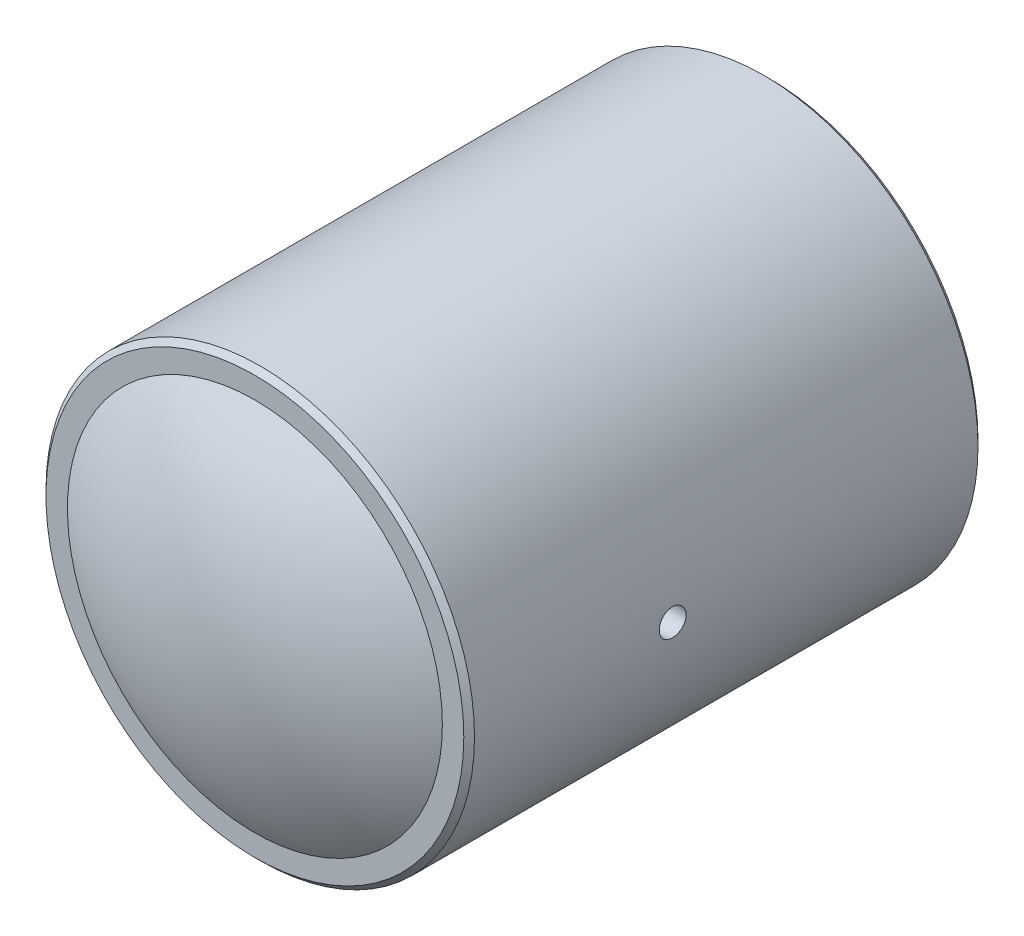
ISO-10303-21;
HEADER;
FILE_DESCRIPTION(('STEP AP214'),'2;1');
FILE_NAME('part.step','',(''),(''),'','','');
FILE_SCHEMA(('AUTOMOTIVE_DESIGN { 1 0 10303 214 1 1 1 1 }'));
ENDSEC;
DATA;
#1=APPLICATION_CONTEXT('core data for automotive mechanical design processes');
#2=APPLICATION_PROTOCOL_DEFINITION('international standard','automotive_design',2000,#1);
#3=PRODUCT_CONTEXT('',#1,'mechanical');
#4=PRODUCT('Part','Part','',(#3));
#5=PRODUCT_RELATED_PRODUCT_CATEGORY('part','',(#4));
#6=PRODUCT_DEFINITION_FORMATION('','',#4);
#7=PRODUCT_DEFINITION_CONTEXT('part definition',#1,'design');
#8=PRODUCT_DEFINITION('design','',#6,#7);
#9=PRODUCT_DEFINITION_SHAPE('','',#8);
#10=(LENGTH_UNIT() NAMED_UNIT(*) SI_UNIT(.MILLI.,.METRE.));
#11=(NAMED_UNIT(*) PLANE_ANGLE_UNIT() SI_UNIT($,.RADIAN.));
#12=(NAMED_UNIT(*) SI_UNIT($,.STERADIAN.) SOLID_ANGLE_UNIT());
#13=UNCERTAINTY_MEASURE_WITH_UNIT(LENGTH_MEASURE(1.E-05),#10,'distance_accuracy_value','');
#14=(GEOMETRIC_REPRESENTATION_CONTEXT(3) GLOBAL_UNCERTAINTY_ASSIGNED_CONTEXT((#13)) GLOBAL_UNIT_ASSIGNED_CONTEXT((#10,
#11,#12)) REPRESENTATION_CONTEXT('',''));
#15=CARTESIAN_POINT('',(0.,0.,0.));
#16=DIRECTION('',(0.,0.,1.));
#17=DIRECTION('',(1.,0.,0.));
#18=AXIS2_PLACEMENT_3D('',#15,#16,#17);
#19=CARTESIAN_POINT('',(0.,0.,3.));
#20=DIRECTION('',(0.,0.,-1.));
#21=DIRECTION('',(-1.,0.,0.));
#22=AXIS2_PLACEMENT_3D('',#19,#20,#21);
#23=CYLINDRICAL_SURFACE('',#22,1.3);
#24=CARTESIAN_POINT('',(0.,0.,3.));
#25=DIRECTION('',(0.,0.,-1.));
#26=DIRECTION('',(-1.,0.,0.));
#27=AXIS2_PLACEMENT_3D('',#24,#25,#26);
#28=CIRCLE('',#27,1.3);
#29=CARTESIAN_POINT('',(0.325000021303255,-1.25871958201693,3.));
#30=VERTEX_POINT('',#29);
#31=CARTESIAN_POINT('',(-0.65,-1.12583302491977,3.));
#32=VERTEX_POINT('',#31);
#33=EDGE_CURVE('E129',#30,#32,#28,.T.);
#34=ORIENTED_EDGE('',*,*,#33,.F.);
#35=CARTESIAN_POINT('',(1.3,0.,0.393749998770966));
#36=CARTESIAN_POINT('',(1.3,0.750555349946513,0.431249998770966));
#37=CARTESIAN_POINT('',(0.65,1.12583302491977,0.468749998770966));
#38=CARTESIAN_POINT('',(0.,1.50111069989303,0.506249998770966));
#39=CARTESIAN_POINT('',(-0.65,1.12583302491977,0.543749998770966));
#40=CARTESIAN_POINT('',(-1.3,0.750555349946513,0.581249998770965));
#41=CARTESIAN_POINT('',(-1.3,0.,0.618749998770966));
#42=CARTESIAN_POINT('',(-1.3,-0.750555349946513,0.656249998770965));
#43=CARTESIAN_POINT('',(-0.65,-1.12583302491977,0.693749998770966));
#44=CARTESIAN_POINT('',(0.,-1.50111069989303,0.731249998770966));
#45=CARTESIAN_POINT('',(0.65,-1.12583302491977,0.768749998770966));
#46=CARTESIAN_POINT('',(1.3,-0.750555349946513,0.806249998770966));
#47=CARTESIAN_POINT('',(1.3,0.,0.843749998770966));
#48=CARTESIAN_POINT('',(1.3,0.750555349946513,0.881249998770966));
#49=CARTESIAN_POINT('',(0.65,1.12583302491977,0.918749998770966));
#50=CARTESIAN_POINT('',(0.,1.50111069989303,0.956249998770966));
#51=CARTESIAN_POINT('',(-0.65,1.12583302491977,0.993749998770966));
#52=CARTESIAN_POINT('',(-1.3,0.750555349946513,1.03124999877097));
#53=CARTESIAN_POINT('',(-1.3,0.,1.06874999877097));
#54=CARTESIAN_POINT('',(-1.3,-0.750555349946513,1.10624999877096));
#55=CARTESIAN_POINT('',(-0.65,-1.12583302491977,1.14374999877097));
#56=CARTESIAN_POINT('',(0.,-1.50111069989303,1.18124999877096));
#57=CARTESIAN_POINT('',(0.65,-1.12583302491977,1.21874999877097));
#58=CARTESIAN_POINT('',(1.3,-0.750555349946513,1.25624999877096));
#59=CARTESIAN_POINT('',(1.3,0.,1.29374999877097));
#60=CARTESIAN_POINT('',(1.3,0.750555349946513,1.33124999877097));
#61=CARTESIAN_POINT('',(0.65,1.12583302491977,1.36874999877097));
#62=CARTESIAN_POINT('',(0.,1.50111069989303,1.40624999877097));
#63=CARTESIAN_POINT('',(-0.65,1.12583302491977,1.44374999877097));
#64=CARTESIAN_POINT('',(-1.3,0.750555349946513,1.48124999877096));
#65=CARTESIAN_POINT('',(-1.3,0.,1.51874999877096));
#66=CARTESIAN_POINT('',(-1.3,-0.750555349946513,1.55624999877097));
#67=CARTESIAN_POINT('',(-0.65,-1.12583302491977,1.59374999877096));
#68=CARTESIAN_POINT('',(0.,-1.50111069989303,1.63124999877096));
#69=CARTESIAN_POINT('',(0.65,-1.12583302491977,1.66874999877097));
#70=CARTESIAN_POINT('',(1.3,-0.750555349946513,1.70624999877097));
#71=CARTESIAN_POINT('',(1.3,0.,1.74374999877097));
#72=CARTESIAN_POINT('',(1.3,0.750555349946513,1.78124999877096));
#73=CARTESIAN_POINT('',(0.65,1.12583302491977,1.81874999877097));
#74=CARTESIAN_POINT('',(0.,1.50111069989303,1.85624999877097));
#75=CARTESIAN_POINT('',(-0.65,1.12583302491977,1.89374999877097));
#76=CARTESIAN_POINT('',(-1.3,0.750555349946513,1.93124999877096));
#77=CARTESIAN_POINT('',(-1.3,0.,1.96874999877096));
#78=CARTESIAN_POINT('',(-1.3,-0.750555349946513,2.00624999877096));
#79=CARTESIAN_POINT('',(-0.65,-1.12583302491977,2.04374999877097));
#80=CARTESIAN_POINT('',(0.,-1.50111069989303,2.08124999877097));
#81=CARTESIAN_POINT('',(0.65,-1.12583302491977,2.11874999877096));
#82=CARTESIAN_POINT('',(1.3,-0.750555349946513,2.15624999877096));
#83=CARTESIAN_POINT('',(1.3,0.,2.19374999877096));
#84=CARTESIAN_POINT('',(1.3,0.750555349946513,2.23124999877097));
#85=CARTESIAN_POINT('',(0.65,1.12583302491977,2.26874999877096));
#86=CARTESIAN_POINT('',(0.,1.50111069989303,2.30624999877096));
#87=CARTESIAN_POINT('',(-0.65,1.12583302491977,2.34374999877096));
#88=CARTESIAN_POINT('',(-1.3,0.750555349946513,2.38124999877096));
#89=CARTESIAN_POINT('',(-1.3,0.,2.41874999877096));
#90=CARTESIAN_POINT('',(-1.3,-0.750555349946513,2.45624999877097));
#91=CARTESIAN_POINT('',(-0.65,-1.12583302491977,2.49374999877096));
#92=CARTESIAN_POINT('',(0.,-1.50111069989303,2.53124999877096));
#93=CARTESIAN_POINT('',(0.65,-1.12583302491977,2.56874999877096));
#94=CARTESIAN_POINT('',(1.3,-0.750555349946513,2.60624999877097));
#95=CARTESIAN_POINT('',(1.3,0.,2.64374999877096));
#96=CARTESIAN_POINT('',(1.3,0.750555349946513,2.68124999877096));
#97=CARTESIAN_POINT('',(0.65,1.12583302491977,2.71874999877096));
#98=CARTESIAN_POINT('',(0.,1.50111069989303,2.75624999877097));
#99=CARTESIAN_POINT('',(-0.65,1.12583302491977,2.79374999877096));
#100=CARTESIAN_POINT('',(-1.3,0.750555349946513,2.83124999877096));
#101=CARTESIAN_POINT('',(-1.3,0.,2.86874999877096));
#102=CARTESIAN_POINT('',(-1.3,-0.750555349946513,2.90624999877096));
#103=CARTESIAN_POINT('',(-0.65,-1.12583302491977,2.94374999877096));
#104=CARTESIAN_POINT('',(0.,-1.50111069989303,2.98124999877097));
#105=CARTESIAN_POINT('',(0.65,-1.12583302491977,3.01874999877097));
#106=CARTESIAN_POINT('',(1.3,-0.750555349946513,3.05624999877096));
#107=CARTESIAN_POINT('',(1.3,0.,3.09374999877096));
#108=CARTESIAN_POINT('',(1.3,0.750555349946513,3.13124999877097));
#109=CARTESIAN_POINT('',(0.65,1.12583302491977,3.16874999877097));
#110=CARTESIAN_POINT('',(0.,1.50111069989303,3.20624999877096));
#111=CARTESIAN_POINT('',(-0.65,1.12583302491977,3.24374999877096));
#112=CARTESIAN_POINT('',(-1.3,0.750555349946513,3.28124999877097));
#113=CARTESIAN_POINT('',(-1.3,0.,3.31874999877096));
#114=CARTESIAN_POINT('',(-1.3,-0.750555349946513,3.35624999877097));
#115=CARTESIAN_POINT('',(-0.65,-1.12583302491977,3.39374999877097));
#116=(BOUNDED_CURVE() B_SPLINE_CURVE(2,(#35,#36,#37,#38,#39,#40,#41,#42,#43,#44,#45,#46,#47,#48,
#49,#50,#51,#52,#53,#54,#55,#56,#57,#58,#59,#60,#61,#62,#63,#64,#65,#66,#67,#68,#69,#70,#71,#72,
#73,#74,#75,#76,#77,#78,#79,#80,#81,#82,#83,#84,#85,#86,#87,#88,#89,#90,#91,#92,#93,#94,#95,#96,
#97,#98,#99,#100,#101,#102,#103,#104,#105,#106,#107,#108,#109,#110,#111,#112,#113,#114,#115),
.UNSPECIFIED.,.F.,.F.) B_SPLINE_CURVE_WITH_KNOTS((3,2,2,2,2,2,2,2,2,2,2,2,2,2,2,2,2,2,2,2,2,2,2,
2,2,2,2,2,2,2,2,2,2,2,2,2,2,2,2,2,3),(0.,0.0238095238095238,0.0476190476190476,
0.0714285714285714,0.0952380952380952,0.119047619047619,0.142857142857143,0.166666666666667,
0.19047619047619,0.214285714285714,0.238095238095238,0.261904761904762,0.285714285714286,
0.309523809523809,0.333333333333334,0.357142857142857,0.380952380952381,0.404761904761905,
0.428571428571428,0.452380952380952,0.476190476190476,0.5,0.523809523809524,0.547619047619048,
0.571428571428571,0.595238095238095,0.619047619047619,0.642857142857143,0.666666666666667,
0.690476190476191,0.714285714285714,0.738095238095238,0.761904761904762,0.785714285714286,
0.80952380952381,0.833333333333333,0.857142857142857,0.880952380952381,0.904761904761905,
0.928571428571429,0.952380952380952),
.UNSPECIFIED.) CURVE() GEOMETRIC_REPRESENTATION_ITEM() RATIONAL_B_SPLINE_CURVE((1.,
0.866025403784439,1.,0.866025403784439,1.,0.866025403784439,1.,0.866025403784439,1.,
0.866025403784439,1.,0.866025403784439,1.,0.866025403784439,1.,0.866025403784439,1.,
0.866025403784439,1.,0.866025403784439,1.,0.866025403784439,1.,0.866025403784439,1.,
0.866025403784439,1.,0.866025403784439,1.,0.866025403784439,1.,0.866025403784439,1.,
0.866025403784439,1.,0.866025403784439,1.,0.866025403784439,1.,0.866025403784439,1.,
0.866025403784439,1.,0.866025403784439,1.,0.866025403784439,1.,0.866025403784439,1.,
0.866025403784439,1.,0.866025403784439,1.,0.866025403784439,1.,0.866025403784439,1.,
0.866025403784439,1.,0.866025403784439,1.,0.866025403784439,1.,0.866025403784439,1.,
0.866025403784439,1.,0.866025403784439,1.,0.866025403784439,1.,0.866025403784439,1.,
0.866025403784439,1.,0.866025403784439,1.,0.866025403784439,1.,0.866025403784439,1.)) REPRESENTATION_ITEM(''));
#117=CARTESIAN_POINT('',(1.3,0.,0.393749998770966));
#118=VERTEX_POINT('',#117);
#119=EDGE_CURVE('E159',#118,#30,#116,.T.);
#120=ORIENTED_EDGE('',*,*,#119,.F.);
#121=DIRECTION('',(0.,0.,1.));
#122=VECTOR('',#121,1.);
#123=CARTESIAN_POINT('',(1.3,0.,0.196874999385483));
#124=LINE('',#123,#122);
#125=CARTESIAN_POINT('',(1.3,0.,0.));
#126=VERTEX_POINT('',#125);
#127=EDGE_CURVE('E160',#126,#118,#124,.T.);
#128=ORIENTED_EDGE('',*,*,#127,.F.);
#129=CARTESIAN_POINT('',(0.,0.,0.));
#130=DIRECTION('',(0.,0.,-1.));
#131=DIRECTION('',(-1.,0.,0.));
#132=AXIS2_PLACEMENT_3D('',#129,#130,#131);
#133=CIRCLE('',#132,1.3);
#134=EDGE_CURVE('E126',#126,#126,#133,.T.);
#135=ORIENTED_EDGE('',*,*,#134,.T.);
#136=CARTESIAN_POINT('',(1.3,0.,0.));
#137=CARTESIAN_POINT('',(1.3,0.750555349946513,0.0375));
#138=CARTESIAN_POINT('',(0.65,1.12583302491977,0.075));
#139=CARTESIAN_POINT('',(0.,1.50111069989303,0.1125));
#140=CARTESIAN_POINT('',(-0.65,1.12583302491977,0.15));
#141=CARTESIAN_POINT('',(-1.3,0.750555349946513,0.1875));
#142=CARTESIAN_POINT('',(-1.3,0.,0.225));
#143=CARTESIAN_POINT('',(-1.3,-0.750555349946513,0.2625));
#144=CARTESIAN_POINT('',(-0.65,-1.12583302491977,0.3));
#145=CARTESIAN_POINT('',(0.,-1.50111069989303,0.3375));
#146=CARTESIAN_POINT('',(0.65,-1.12583302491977,0.375));
#147=CARTESIAN_POINT('',(1.3,-0.750555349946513,0.4125));
#148=CARTESIAN_POINT('',(1.3,0.,0.45));
#149=CARTESIAN_POINT('',(1.3,0.750555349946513,0.4875));
#150=CARTESIAN_POINT('',(0.65,1.12583302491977,0.525));
#151=CARTESIAN_POINT('',(0.,1.50111069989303,0.5625));
#152=CARTESIAN_POINT('',(-0.65,1.12583302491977,0.6));
#153=CARTESIAN_POINT('',(-1.3,0.750555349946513,0.6375));
#154=CARTESIAN_POINT('',(-1.3,0.,0.675));
#155=CARTESIAN_POINT('',(-1.3,-0.750555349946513,0.7125));
#156=CARTESIAN_POINT('',(-0.65,-1.12583302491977,0.75));
#157=CARTESIAN_POINT('',(0.,-1.50111069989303,0.787499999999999));
#158=CARTESIAN_POINT('',(0.65,-1.12583302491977,0.825));
#159=CARTESIAN_POINT('',(1.3,-0.750555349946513,0.862499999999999));
#160=CARTESIAN_POINT('',(1.3,0.,0.9));
#161=CARTESIAN_POINT('',(1.3,0.750555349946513,0.937499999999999));
#162=CARTESIAN_POINT('',(0.65,1.12583302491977,0.975));
#163=CARTESIAN_POINT('',(0.,1.50111069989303,1.0125));
#164=CARTESIAN_POINT('',(-0.65,1.12583302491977,1.05));
#165=CARTESIAN_POINT('',(-1.3,0.750555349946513,1.0875));
#166=CARTESIAN_POINT('',(-1.3,0.,1.125));
#167=CARTESIAN_POINT('',(-1.3,-0.750555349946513,1.1625));
#168=CARTESIAN_POINT('',(-0.65,-1.12583302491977,1.2));
#169=CARTESIAN_POINT('',(0.,-1.50111069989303,1.2375));
#170=CARTESIAN_POINT('',(0.65,-1.12583302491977,1.275));
#171=CARTESIAN_POINT('',(1.3,-0.750555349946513,1.3125));
#172=CARTESIAN_POINT('',(1.3,0.,1.35));
#173=CARTESIAN_POINT('',(1.3,0.750555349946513,1.3875));
#174=CARTESIAN_POINT('',(0.65,1.12583302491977,1.425));
#175=CARTESIAN_POINT('',(0.,1.50111069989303,1.4625));
#176=CARTESIAN_POINT('',(-0.65,1.12583302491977,1.5));
#177=CARTESIAN_POINT('',(-1.3,0.750555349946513,1.5375));
#178=CARTESIAN_POINT('',(-1.3,0.,1.575));
#179=CARTESIAN_POINT('',(-1.3,-0.750555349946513,1.6125));
#180=CARTESIAN_POINT('',(-0.65,-1.12583302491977,1.65));
#181=CARTESIAN_POINT('',(0.,-1.50111069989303,1.6875));
#182=CARTESIAN_POINT('',(0.65,-1.12583302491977,1.725));
#183=CARTESIAN_POINT('',(1.3,-0.750555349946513,1.7625));
#184=CARTESIAN_POINT('',(1.3,0.,1.8));
#185=CARTESIAN_POINT('',(1.3,0.750555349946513,1.8375));
#186=CARTESIAN_POINT('',(0.65,1.12583302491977,1.875));
#187=CARTESIAN_POINT('',(0.,1.50111069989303,1.9125));
#188=CARTESIAN_POINT('',(-0.65,1.12583302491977,1.95));
#189=CARTESIAN_POINT('',(-1.3,0.750555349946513,1.9875));
#190=CARTESIAN_POINT('',(-1.3,0.,2.025));
#191=CARTESIAN_POINT('',(-1.3,-0.750555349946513,2.0625));
#192=CARTESIAN_POINT('',(-0.65,-1.12583302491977,2.1));
#193=CARTESIAN_POINT('',(0.,-1.50111069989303,2.1375));
#194=CARTESIAN_POINT('',(0.65,-1.12583302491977,2.175));
#195=CARTESIAN_POINT('',(1.3,-0.750555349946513,2.2125));
#196=CARTESIAN_POINT('',(1.3,0.,2.25));
#197=CARTESIAN_POINT('',(1.3,0.750555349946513,2.2875));
#198=CARTESIAN_POINT('',(0.65,1.12583302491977,2.325));
#199=CARTESIAN_POINT('',(0.,1.50111069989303,2.3625));
#200=CARTESIAN_POINT('',(-0.65,1.12583302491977,2.4));
#201=CARTESIAN_POINT('',(-1.3,0.750555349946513,2.4375));
#202=CARTESIAN_POINT('',(-1.3,0.,2.475));
#203=CARTESIAN_POINT('',(-1.3,-0.750555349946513,2.5125));
#204=CARTESIAN_POINT('',(-0.65,-1.12583302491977,2.55));
#205=CARTESIAN_POINT('',(0.,-1.50111069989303,2.5875));
#206=CARTESIAN_POINT('',(0.65,-1.12583302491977,2.625));
#207=CARTESIAN_POINT('',(1.3,-0.750555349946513,2.6625));
#208=CARTESIAN_POINT('',(1.3,0.,2.7));
#209=CARTESIAN_POINT('',(1.3,0.750555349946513,2.7375));
#210=CARTESIAN_POINT('',(0.65,1.12583302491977,2.775));
#211=CARTESIAN_POINT('',(0.,1.50111069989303,2.8125));
#212=CARTESIAN_POINT('',(-0.65,1.12583302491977,2.85));
#213=CARTESIAN_POINT('',(-1.3,0.750555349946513,2.8875));
#214=CARTESIAN_POINT('',(-1.3,0.,2.925));
#215=CARTESIAN_POINT('',(-1.3,-0.750555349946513,2.9625));
#216=CARTESIAN_POINT('',(-0.65,-1.12583302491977,3.));
#217=(BOUNDED_CURVE() B_SPLINE_CURVE(2,(#136,#137,#138,#139,#140,#141,#142,#143,#144,#145,#146,
#147,#148,#149,#150,#151,#152,#153,#154,#155,#156,#157,#158,#159,#160,#161,#162,#163,#164,#165,
#166,#167,#168,#169,#170,#171,#172,#173,#174,#175,#176,#177,#178,#179,#180,#181,#182,#183,#184,
#185,#186,#187,#188,#189,#190,#191,#192,#193,#194,#195,#196,#197,#198,#199,#200,#201,#202,#203,
#204,#205,#206,#207,#208,#209,#210,#211,#212,#213,#214,#215,#216),.UNSPECIFIED.,.F.,
.F.) B_SPLINE_CURVE_WITH_KNOTS((3,2,2,2,2,2,2,2,2,2,2,2,2,2,2,2,2,2,2,2,2,2,2,2,2,2,2,2,2,2,2,2,
2,2,2,2,2,2,2,2,3),(0.,0.0238095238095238,0.0476190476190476,0.0714285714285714,
0.0952380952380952,0.119047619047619,0.142857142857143,0.166666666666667,0.19047619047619,
0.214285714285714,0.238095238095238,0.261904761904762,0.285714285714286,0.309523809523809,
0.333333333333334,0.357142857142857,0.380952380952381,0.404761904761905,0.428571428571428,
0.452380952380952,0.476190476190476,0.5,0.523809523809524,0.547619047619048,0.571428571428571,
0.595238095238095,0.619047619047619,0.642857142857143,0.666666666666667,0.690476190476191,
0.714285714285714,0.738095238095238,0.761904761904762,0.785714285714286,0.80952380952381,
0.833333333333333,0.857142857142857,0.880952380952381,0.904761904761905,0.928571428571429,
0.952380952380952),
.UNSPECIFIED.) CURVE() GEOMETRIC_REPRESENTATION_ITEM() RATIONAL_B_SPLINE_CURVE((1.,
0.866025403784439,1.,0.866025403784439,1.,0.866025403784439,1.,0.866025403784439,1.,
0.866025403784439,1.,0.866025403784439,1.,0.866025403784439,1.,0.866025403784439,1.,
0.866025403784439,1.,0.866025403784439,1.,0.866025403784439,1.,0.866025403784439,1.,
0.866025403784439,1.,0.866025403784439,1.,0.866025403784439,1.,0.866025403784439,1.,
0.866025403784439,1.,0.866025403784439,1.,0.866025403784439,1.,0.866025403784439,1.,
0.866025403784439,1.,0.866025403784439,1.,0.866025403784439,1.,0.866025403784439,1.,
0.866025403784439,1.,0.866025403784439,1.,0.866025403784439,1.,0.866025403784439,1.,
0.866025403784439,1.,0.866025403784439,1.,0.866025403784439,1.,0.866025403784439,1.,
0.866025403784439,1.,0.866025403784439,1.,0.866025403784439,1.,0.866025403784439,1.,
0.866025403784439,1.,0.866025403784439,1.,0.866025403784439,1.,0.866025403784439,1.)) REPRESENTATION_ITEM(''));
#218=EDGE_CURVE('E147',#126,#32,#217,.T.);
#219=ORIENTED_EDGE('',*,*,#218,.T.);
#220=EDGE_LOOP('',(#34,#120,#128,#135,#219));
#221=FACE_BOUND('',#220,.T.);
#222=ADVANCED_FACE('F16',(#221),#23,.F.);
#223=CARTESIAN_POINT('',(0.,0.,3.));
#224=DIRECTION('',(0.,0.,-1.));
#225=DIRECTION('',(-1.,0.,0.));
#226=AXIS2_PLACEMENT_3D('',#223,#224,#225);
#227=PLANE('',#226);
#228=ORIENTED_EDGE('',*,*,#33,.T.);
#229=CARTESIAN_POINT('',(-0.65,-1.12583302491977,3.));
#230=CARTESIAN_POINT('',(-0.67842906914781,-1.10596650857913,3.));
#231=CARTESIAN_POINT('',(-0.7060071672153,-1.08491079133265,3.));
#232=CARTESIAN_POINT('',(-0.759292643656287,-1.0405537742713,3.));
#233=CARTESIAN_POINT('',(-0.785000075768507,-1.01725253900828,3.));
#234=CARTESIAN_POINT('',(-0.858970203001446,-0.944272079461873,3.));
#235=CARTESIAN_POINT('',(-0.904191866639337,-0.891438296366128,3.));
#236=CARTESIAN_POINT('',(-0.985092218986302,-0.778927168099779,3.));
#237=CARTESIAN_POINT('',(-1.02076851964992,-0.719248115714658,3.));
#238=CARTESIAN_POINT('',(-1.08156743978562,-0.594741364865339,3.));
#239=CARTESIAN_POINT('',(-1.10669081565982,-0.52991403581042,3.));
#240=CARTESIAN_POINT('',(-1.1455973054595,-0.397116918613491,3.));
#241=CARTESIAN_POINT('',(-1.15941387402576,-0.329157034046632,3.));
#242=CARTESIAN_POINT('',(-1.17144989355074,-0.226263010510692,3.));
#243=CARTESIAN_POINT('',(-1.17401266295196,-0.191784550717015,3.));
#244=CARTESIAN_POINT('',(-1.17622063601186,-0.122721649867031,3.));
#245=CARTESIAN_POINT('',(-1.17586532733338,-0.0881371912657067,3.));
#246=CARTESIAN_POINT('',(-1.17227188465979,-0.0189497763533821,3.));
#247=CARTESIAN_POINT('',(-1.16902012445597,0.0156524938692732,3.));
#248=CARTESIAN_POINT('',(-1.15924624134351,0.0843819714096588,3.));
#249=CARTESIAN_POINT('',(-1.15272573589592,0.118509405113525,3.));
#250=CARTESIAN_POINT('',(-1.13651329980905,0.18594757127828,3.));
#251=CARTESIAN_POINT('',(-1.12682618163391,0.21925946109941,3.));
#252=CARTESIAN_POINT('',(-1.1043435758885,0.284855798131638,3.));
#253=CARTESIAN_POINT('',(-1.09154415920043,0.317138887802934,3.));
#254=CARTESIAN_POINT('',(-1.05132245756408,0.406036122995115,3.));
#255=CARTESIAN_POINT('',(-1.02046192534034,0.461138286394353,3.));
#256=CARTESIAN_POINT('',(-0.94979253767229,0.565204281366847,3.));
#257=CARTESIAN_POINT('',(-0.909989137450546,0.614171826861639,3.));
#258=CARTESIAN_POINT('',(-0.834085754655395,0.692703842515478,3.));
#259=CARTESIAN_POINT('',(-0.799748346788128,0.723990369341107,3.));
#260=CARTESIAN_POINT('',(-0.727471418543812,0.781933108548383,3.));
#261=CARTESIAN_POINT('',(-0.68953864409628,0.808597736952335,3.));
#262=CARTESIAN_POINT('',(-0.650050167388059,0.832754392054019,3.));
#263=B_SPLINE_CURVE_WITH_KNOTS('',3,(#229,#230,#231,#232,#233,#234,#235,#236,#237,#238,#239,
#240,#241,#242,#243,#244,#245,#246,#247,#248,#249,#250,#251,#252,#253,#254,#255,#256,#257,#258,
#259,#260,#261,#262),.UNSPECIFIED.,.F.,.F.,(4,2,2,2,2,2,2,2,2,2,2,2,2,2,2,2,4),(0.,
0.103984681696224,0.207966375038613,0.415527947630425,0.623141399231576,0.830739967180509,
1.03772204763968,1.14134014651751,1.24497643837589,1.34910287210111,1.45317783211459,
1.55709535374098,1.66114475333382,1.84961977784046,2.03798014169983,2.17698344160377,
2.31573090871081),.UNSPECIFIED.);
#264=CARTESIAN_POINT('',(-0.650050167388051,0.832754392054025,3.));
#265=VERTEX_POINT('',#264);
#266=EDGE_CURVE('E74',#32,#265,#263,.T.);
#267=ORIENTED_EDGE('',*,*,#266,.T.);
#268=CARTESIAN_POINT('',(-0.65005016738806,0.832754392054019,3.));
#269=CARTESIAN_POINT('',(-0.620272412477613,0.856001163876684,3.));
#270=CARTESIAN_POINT('',(-0.589263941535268,0.877632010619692,3.));
#271=CARTESIAN_POINT('',(-0.525065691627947,0.917486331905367,3.));
#272=CARTESIAN_POINT('',(-0.491872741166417,0.935704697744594,3.));
#273=CARTESIAN_POINT('',(-0.40427006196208,0.977817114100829,3.));
#274=CARTESIAN_POINT('',(-0.348536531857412,0.999040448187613,3.));
#275=CARTESIAN_POINT('',(-0.262933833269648,1.02361988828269,3.));
#276=CARTESIAN_POINT('',(-0.234049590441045,1.03060559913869,3.));
#277=CARTESIAN_POINT('',(-0.175768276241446,1.0421292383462,3.));
#278=CARTESIAN_POINT('',(-0.146370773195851,1.04666499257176,3.));
#279=CARTESIAN_POINT('',(-0.0578162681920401,1.05651368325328,3.));
#280=CARTESIAN_POINT('',(0.00179895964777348,1.05809557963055,3.));
#281=CARTESIAN_POINT('',(0.120418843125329,1.05122734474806,3.));
#282=CARTESIAN_POINT('',(0.179423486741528,1.04277701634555,3.));
#283=CARTESIAN_POINT('',(0.295178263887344,1.01609004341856,3.));
#284=CARTESIAN_POINT('',(0.351928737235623,0.997854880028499,3.));
#285=CARTESIAN_POINT('',(0.461568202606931,0.952120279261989,3.));
#286=CARTESIAN_POINT('',(0.514456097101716,0.924618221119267,3.));
#287=CARTESIAN_POINT('',(0.617905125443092,0.859183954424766,3.));
#288=CARTESIAN_POINT('',(0.668136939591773,0.820725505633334,3.));
#289=CARTESIAN_POINT('',(0.737737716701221,0.756827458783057,3.));
#290=CARTESIAN_POINT('',(0.760003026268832,0.734462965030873,3.));
#291=CARTESIAN_POINT('',(0.802448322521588,0.687833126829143,3.));
#292=CARTESIAN_POINT('',(0.822628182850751,0.663567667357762,3.));
#293=CARTESIAN_POINT('',(0.841692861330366,0.638434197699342,3.));
#294=B_SPLINE_CURVE_WITH_KNOTS('',3,(#268,#269,#270,#271,#272,#273,#274,#275,#276,#277,#278,
#279,#280,#281,#282,#283,#284,#285,#286,#287,#288,#289,#290,#291,#292,#293),.UNSPECIFIED.,.F.,
.F.,(4,2,2,2,2,2,2,2,2,2,2,2,4),(0.,0.113229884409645,0.226627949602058,0.404562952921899,
0.493627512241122,0.582770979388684,0.760761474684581,0.938755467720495,1.11672252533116,
1.29473995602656,1.48342442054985,1.57799017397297,1.67256165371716),.UNSPECIFIED.);
#295=CARTESIAN_POINT('',(0.841692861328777,0.638434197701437,3.00000000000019));
#296=VERTEX_POINT('',#295);
#297=EDGE_CURVE('E157',#265,#296,#294,.T.);
#298=ORIENTED_EDGE('',*,*,#297,.T.);
#299=CARTESIAN_POINT('',(0.841692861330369,0.638434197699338,3.));
#300=CARTESIAN_POINT('',(0.87878524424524,0.600242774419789,3.));
#301=CARTESIAN_POINT('',(0.912954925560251,0.559257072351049,3.));
#302=CARTESIAN_POINT('',(0.974793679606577,0.472689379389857,3.));
#303=CARTESIAN_POINT('',(1.00246756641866,0.427110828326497,3.));
#304=CARTESIAN_POINT('',(1.05375679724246,0.326315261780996,3.));
#305=CARTESIAN_POINT('',(1.07642116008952,0.27060744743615,3.));
#306=CARTESIAN_POINT('',(1.10317654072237,0.184861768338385,3.));
#307=CARTESIAN_POINT('',(1.11089007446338,0.155901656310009,3.));
#308=CARTESIAN_POINT('',(1.12386716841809,0.097429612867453,3.));
#309=CARTESIAN_POINT('',(1.12913091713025,0.0679177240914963,3.));
#310=CARTESIAN_POINT('',(1.13715496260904,0.0085760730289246,3.));
#311=CARTESIAN_POINT('',(1.13991634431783,-0.0212535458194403,3.));
#312=CARTESIAN_POINT('',(1.14323435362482,-0.0810350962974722,3.));
#313=CARTESIAN_POINT('',(1.14379066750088,-0.110987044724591,3.));
#314=CARTESIAN_POINT('',(1.14264656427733,-0.170874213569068,3.));
#315=CARTESIAN_POINT('',(1.14094444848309,-0.200809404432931,3.));
#316=CARTESIAN_POINT('',(1.13530398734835,-0.26045909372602,3.));
#317=CARTESIAN_POINT('',(1.13136569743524,-0.290173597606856,3.));
#318=CARTESIAN_POINT('',(1.11511065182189,-0.385177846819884,3.));
#319=CARTESIAN_POINT('',(1.09842936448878,-0.449780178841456,3.));
#320=CARTESIAN_POINT('',(1.05458709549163,-0.575264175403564,3.));
#321=CARTESIAN_POINT('',(1.02742901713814,-0.636146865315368,3.));
#322=CARTESIAN_POINT('',(0.963012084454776,-0.753267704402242,3.));
#323=CARTESIAN_POINT('',(0.925636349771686,-0.809441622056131,3.));
#324=CARTESIAN_POINT('',(0.84197881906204,-0.914734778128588,3.));
#325=CARTESIAN_POINT('',(0.795698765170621,-0.963855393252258,3.));
#326=CARTESIAN_POINT('',(0.720642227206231,-1.03120400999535,3.));
#327=CARTESIAN_POINT('',(0.694655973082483,-1.05261588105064,3.));
#328=CARTESIAN_POINT('',(0.640990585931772,-1.09316688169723,3.));
#329=CARTESIAN_POINT('',(0.613312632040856,-1.11230756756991,2.99999999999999));
#330=CARTESIAN_POINT('',(0.556630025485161,-1.14844992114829,3.00000000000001));
#331=CARTESIAN_POINT('',(0.52762635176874,-1.16545313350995,3.00000000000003));
#332=CARTESIAN_POINT('',(0.468406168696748,-1.19720388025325,2.99999999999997));
#333=CARTESIAN_POINT('',(0.438189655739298,-1.21195140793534,2.99999999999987));
#334=CARTESIAN_POINT('',(0.380351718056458,-1.23751134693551,2.99999999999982));
#335=CARTESIAN_POINT('',(0.352844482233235,-1.24858272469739,2.99999999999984));
#336=CARTESIAN_POINT('',(0.325000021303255,-1.25871958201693,3.));
#337=B_SPLINE_CURVE_WITH_KNOTS('',3,(#299,#300,#301,#302,#303,#304,#305,#306,#307,#308,#309,
#310,#311,#312,#313,#314,#315,#316,#317,#318,#319,#320,#321,#322,#323,#324,#325,#326,#327,#328,
#329,#330,#331,#332,#333,#334,#335,#336),.UNSPECIFIED.,.F.,.F.,(4,2,2,2,2,2,2,2,2,2,2,2,2,2,2,2,
2,2,4),(0.,0.159511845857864,0.318905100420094,0.498385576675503,0.58821089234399,
0.678029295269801,0.767808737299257,0.857600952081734,0.94746074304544,1.03731830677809,
1.23646562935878,1.435557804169,1.6370302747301,1.83846336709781,1.93937620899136,
2.04021949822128,2.14098948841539,2.24175977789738,2.3306464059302),.UNSPECIFIED.);
#338=EDGE_CURVE('E152',#296,#30,#337,.T.);
#339=ORIENTED_EDGE('',*,*,#338,.T.);
#340=EDGE_LOOP('',(#228,#267,#298,#339));
#341=FACE_BOUND('',#340,.T.);
#342=ADVANCED_FACE('F99',(#341),#227,.T.);
#343=CARTESIAN_POINT('',(0.,0.,9.6));
#344=DIRECTION('',(0.,0.,-1.));
#345=DIRECTION('',(-1.,0.,0.));
#346=AXIS2_PLACEMENT_3D('',#343,#344,#345);
#347=CYLINDRICAL_SURFACE('',#346,4.);
#348=CARTESIAN_POINT('',(-4.,0.,6.05));
#349=CARTESIAN_POINT('',(-4.00000002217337,-0.00427177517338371,6.0500001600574));
#350=CARTESIAN_POINT('',(-3.99999315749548,-0.00854402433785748,6.04990650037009));
#351=CARTESIAN_POINT('',(-3.99996603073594,-0.0170097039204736,6.0495255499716));
#352=CARTESIAN_POINT('',(-3.99994598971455,-0.0212032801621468,6.04924145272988));
#353=CARTESIAN_POINT('',(-3.9998932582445,-0.0295117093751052,6.04847973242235));
#354=CARTESIAN_POINT('',(-3.99986075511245,-0.0336268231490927,6.04800497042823));
#355=CARTESIAN_POINT('',(-3.99978386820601,-0.0417781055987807,6.04686232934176));
#356=CARTESIAN_POINT('',(-3.9997396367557,-0.045814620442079,6.04619691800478));
#357=CARTESIAN_POINT('',(-3.99964003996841,-0.0538086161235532,6.04467338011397));
#358=CARTESIAN_POINT('',(-3.99958479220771,-0.0577664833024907,6.04381727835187));
#359=CARTESIAN_POINT('',(-3.99946389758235,-0.0656031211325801,6.04191282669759));
#360=CARTESIAN_POINT('',(-3.99939833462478,-0.069482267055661,6.04086601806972));
#361=CARTESIAN_POINT('',(-3.99925752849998,-0.0771614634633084,6.03858065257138));
#362=CARTESIAN_POINT('',(-3.99918233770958,-0.0809618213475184,6.03734312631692));
#363=CARTESIAN_POINT('',(-3.99902297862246,-0.0884835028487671,6.03467684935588));
#364=CARTESIAN_POINT('',(-3.99893883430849,-0.0922050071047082,6.03324860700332));
#365=CARTESIAN_POINT('',(-3.9987622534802,-0.0995691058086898,6.03020142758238));
#366=CARTESIAN_POINT('',(-3.99866981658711,-0.103211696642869,6.02858248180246));
#367=CARTESIAN_POINT('',(-3.99847731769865,-0.110418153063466,6.02515441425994));
#368=CARTESIAN_POINT('',(-3.99837723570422,-0.113981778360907,6.02334478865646));
#369=CARTESIAN_POINT('',(-3.99817009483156,-0.121030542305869,6.01953585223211));
#370=CARTESIAN_POINT('',(-3.9980630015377,-0.124515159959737,6.01753557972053));
#371=CARTESIAN_POINT('',(-3.9978424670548,-0.131406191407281,6.01334579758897));
#372=CARTESIAN_POINT('',(-3.99772898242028,-0.134811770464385,6.01115491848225));
#373=CARTESIAN_POINT('',(-3.99749627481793,-0.141545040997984,6.00658431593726));
#374=CARTESIAN_POINT('',(-3.99737700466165,-0.144871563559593,6.00420287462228));
#375=CARTESIAN_POINT('',(-3.99713331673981,-0.151447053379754,5.99925147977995));
#376=CARTESIAN_POINT('',(-3.99700885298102,-0.154694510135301,5.99667952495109));
#377=CARTESIAN_POINT('',(-3.99675534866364,-0.161112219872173,5.99134735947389));
#378=CARTESIAN_POINT('',(-3.99662626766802,-0.164280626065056,5.98858493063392));
#379=CARTESIAN_POINT('',(-3.99636408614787,-0.170540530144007,5.98287203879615));
#380=CARTESIAN_POINT('',(-3.99623095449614,-0.17362986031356,5.97991920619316));
#381=CARTESIAN_POINT('',(-3.99596349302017,-0.179680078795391,5.97387746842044));
#382=CARTESIAN_POINT('',(-3.99582916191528,-0.182640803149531,5.97078839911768));
#383=CARTESIAN_POINT('',(-3.99556319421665,-0.188368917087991,5.96452887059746));
#384=CARTESIAN_POINT('',(-3.99543154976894,-0.191138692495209,5.96136059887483));
#385=CARTESIAN_POINT('',(-3.99517217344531,-0.196485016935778,5.95494300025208));
#386=CARTESIAN_POINT('',(-3.9950444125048,-0.199063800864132,5.95169553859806));
#387=CARTESIAN_POINT('',(-3.99479392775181,-0.204028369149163,5.94511989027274));
#388=CARTESIAN_POINT('',(-3.99467116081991,-0.206416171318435,5.94179323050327));
#389=CARTESIAN_POINT('',(-3.99443170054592,-0.21099905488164,5.93505953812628));
#390=CARTESIAN_POINT('',(-3.99431495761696,-0.213195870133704,5.93165368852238));
#391=CARTESIAN_POINT('',(-3.9940884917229,-0.217397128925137,5.92476196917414));
#392=CARTESIAN_POINT('',(-3.99397872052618,-0.219402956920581,5.92127694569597));
#393=CARTESIAN_POINT('',(-3.99376705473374,-0.22322265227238,5.9142272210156));
#394=CARTESIAN_POINT('',(-3.99366512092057,-0.225037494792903,5.9106630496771));
#395=CARTESIAN_POINT('',(-3.99346989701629,-0.228475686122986,5.90345534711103));
#396=CARTESIAN_POINT('',(-3.99337658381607,-0.230099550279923,5.89981206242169));
#397=CARTESIAN_POINT('',(-3.99319927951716,-0.233156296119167,5.89244641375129));
#398=CARTESIAN_POINT('',(-3.9931152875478,-0.234589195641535,5.88872405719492));
#399=CARTESIAN_POINT('',(-3.99295721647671,-0.237264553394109,5.88120049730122));
#400=CARTESIAN_POINT('',(-3.99288316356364,-0.238506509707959,5.87739911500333));
#401=CARTESIAN_POINT('',(-3.99274547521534,-0.240800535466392,5.86971768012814));
#402=CARTESIAN_POINT('',(-3.99268189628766,-0.241851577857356,5.86583732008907));
#403=CARTESIAN_POINT('',(-3.99256557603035,-0.243764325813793,5.85799804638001));
#404=CARTESIAN_POINT('',(-3.99251292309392,-0.244624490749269,5.85403875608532));
#405=CARTESIAN_POINT('',(-3.99241879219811,-0.246156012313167,5.84604167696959));
#406=CARTESIAN_POINT('',(-3.99237743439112,-0.246825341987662,5.84200349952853));
#407=CARTESIAN_POINT('',(-3.99230615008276,-0.247975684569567,5.83384864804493));
#408=CARTESIAN_POINT('',(-3.99227637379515,-0.248454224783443,5.82973162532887));
#409=CARTESIAN_POINT('',(-3.99222842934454,-0.24922343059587,5.82141901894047));
#410=CARTESIAN_POINT('',(-3.99221043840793,-0.249511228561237,5.81722317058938));
#411=CARTESIAN_POINT('',(-3.99218616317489,-0.249899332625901,5.80875286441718));
#412=CARTESIAN_POINT('',(-3.99218007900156,-0.249996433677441,5.80447826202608));
#413=CARTESIAN_POINT('',(-3.99217964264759,-0.25000340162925,5.79592756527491));
#414=CARTESIAN_POINT('',(-3.99218529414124,-0.249913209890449,5.79165147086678));
#415=CARTESIAN_POINT('',(-3.99220872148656,-0.249538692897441,5.78317793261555));
#416=CARTESIAN_POINT('',(-3.99222629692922,-0.249257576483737,5.77898034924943));
#417=CARTESIAN_POINT('',(-3.9922734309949,-0.248501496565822,5.77066402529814));
#418=CARTESIAN_POINT('',(-3.99230281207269,-0.248029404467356,5.76654502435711));
#419=CARTESIAN_POINT('',(-3.99237332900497,-0.246891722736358,5.75838596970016));
#420=CARTESIAN_POINT('',(-3.99241431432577,-0.246228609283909,5.75434557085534));
#421=CARTESIAN_POINT('',(-3.99250772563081,-0.244709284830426,5.74634380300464));
#422=CARTESIAN_POINT('',(-3.99256003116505,-0.243855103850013,5.74238204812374));
#423=CARTESIAN_POINT('',(-3.99267568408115,-0.241954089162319,5.73453760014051));
#424=CARTESIAN_POINT('',(-3.99273894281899,-0.240908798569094,5.73065453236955));
#425=CARTESIAN_POINT('',(-3.99287602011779,-0.238626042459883,5.7229674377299));
#426=CARTESIAN_POINT('',(-3.99294978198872,-0.237389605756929,5.71916310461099));
#427=CARTESIAN_POINT('',(-3.99310730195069,-0.234725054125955,5.71163339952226));
#428=CARTESIAN_POINT('',(-3.99319103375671,-0.233297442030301,5.70790784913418));
#429=CARTESIAN_POINT('',(-3.99336785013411,-0.230251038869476,5.70053556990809));
#430=CARTESIAN_POINT('',(-3.99346093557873,-0.228632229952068,5.69688884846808));
#431=CARTESIAN_POINT('',(-3.99365573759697,-0.225203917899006,5.6896740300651));
#432=CARTESIAN_POINT('',(-3.9937574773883,-0.223393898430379,5.68610617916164));
#433=CARTESIAN_POINT('',(-3.99396878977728,-0.21958361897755,5.6790488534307));
#434=CARTESIAN_POINT('',(-3.99407840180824,-0.217582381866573,5.67555990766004));
#435=CARTESIAN_POINT('',(-3.99430458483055,-0.213390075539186,5.66866010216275));
#436=CARTESIAN_POINT('',(-3.99442120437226,-0.211197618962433,5.66525008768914));
#437=CARTESIAN_POINT('',(-3.9946604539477,-0.206623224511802,5.65850782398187));
#438=CARTESIAN_POINT('',(-3.99478313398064,-0.204239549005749,5.65517675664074));
#439=CARTESIAN_POINT('',(-3.99503348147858,-0.199283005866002,5.64859205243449));
#440=CARTESIAN_POINT('',(-3.99516119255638,-0.196708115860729,5.64533994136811));
#441=CARTESIAN_POINT('',(-3.99542050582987,-0.191369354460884,5.63891280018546));
#442=CARTESIAN_POINT('',(-3.99555213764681,-0.188603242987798,5.63573963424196));
#443=CARTESIAN_POINT('',(-3.99581811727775,-0.182882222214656,5.62947008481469));
#444=CARTESIAN_POINT('',(-3.99595247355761,-0.179924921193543,5.6263758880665));
#445=CARTESIAN_POINT('',(-3.99622023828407,-0.173876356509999,5.62031878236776));
#446=CARTESIAN_POINT('',(-3.99635364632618,-0.170785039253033,5.61735592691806));
#447=CARTESIAN_POINT('',(-3.99661639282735,-0.164520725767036,5.61162364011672));
#448=CARTESIAN_POINT('',(-3.9967457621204,-0.161349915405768,5.60885182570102));
#449=CARTESIAN_POINT('',(-3.99699985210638,-0.154926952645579,5.60350155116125));
#450=CARTESIAN_POINT('',(-3.99712461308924,-0.151676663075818,5.6009208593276));
#451=CARTESIAN_POINT('',(-3.99736890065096,-0.145095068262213,5.59595264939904));
#452=CARTESIAN_POINT('',(-3.99748847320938,-0.14176528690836,5.5935631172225));
#453=CARTESIAN_POINT('',(-3.9977217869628,-0.135025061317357,5.58897699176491));
#454=CARTESIAN_POINT('',(-3.99783557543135,-0.131615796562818,5.58677866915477));
#455=CARTESIAN_POINT('',(-3.99805671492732,-0.124716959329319,5.58257465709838));
#456=CARTESIAN_POINT('',(-3.99816410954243,-0.121228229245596,5.58056758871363));
#457=CARTESIAN_POINT('',(-3.99837184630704,-0.114170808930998,5.5767457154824));
#458=CARTESIAN_POINT('',(-3.99847222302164,-0.110602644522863,5.57492994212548));
#459=CARTESIAN_POINT('',(-3.99866530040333,-0.103386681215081,5.57149023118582));
#460=CARTESIAN_POINT('',(-3.99875802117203,-0.099739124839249,5.56986578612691));
#461=CARTESIAN_POINT('',(-3.99893515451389,-0.0923646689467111,5.56680825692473));
#462=CARTESIAN_POINT('',(-3.99901956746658,-0.0886377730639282,5.56537516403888));
#463=CARTESIAN_POINT('',(-3.99917944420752,-0.0811048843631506,5.56269983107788));
#464=CARTESIAN_POINT('',(-3.99925488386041,-0.0772987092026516,5.56145810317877));
#465=CARTESIAN_POINT('',(-3.99939616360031,-0.0696074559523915,5.5591649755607));
#466=CARTESIAN_POINT('',(-3.99946195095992,-0.0657220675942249,5.5581146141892));
#467=CARTESIAN_POINT('',(-3.99958326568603,-0.0578725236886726,5.5562036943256));
#468=CARTESIAN_POINT('',(-3.99963870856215,-0.0539079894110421,5.55534468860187));
#469=CARTESIAN_POINT('',(-3.99973866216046,-0.045900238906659,5.55381597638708));
#470=CARTESIAN_POINT('',(-3.99978305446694,-0.0418566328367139,5.55314830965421));
#471=CARTESIAN_POINT('',(-3.99986022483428,-0.0336907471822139,5.55200178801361));
#472=CARTESIAN_POINT('',(-3.99989284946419,-0.0295681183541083,5.55152541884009));
#473=CARTESIAN_POINT('',(-3.99994578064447,-0.0212442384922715,5.55076111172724));
#474=CARTESIAN_POINT('',(-3.99996589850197,-0.017042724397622,5.55047605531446));
#475=CARTESIAN_POINT('',(-3.99999313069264,-0.00856074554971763,5.55009381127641));
#476=CARTESIAN_POINT('',(-4.00000002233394,-0.00428013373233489,5.54999983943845));
#477=CARTESIAN_POINT('',(-4.,0.,5.55));
#478=B_SPLINE_CURVE_WITH_KNOTS('',3,(#348,#349,#350,#351,#352,#353,#354,#355,#356,#357,#358,
#359,#360,#361,#362,#363,#364,#365,#366,#367,#368,#369,#370,#371,#372,#373,#374,#375,#376,#377,
#378,#379,#380,#381,#382,#383,#384,#385,#386,#387,#388,#389,#390,#391,#392,#393,#394,#395,#396,
#397,#398,#399,#400,#401,#402,#403,#404,#405,#406,#407,#408,#409,#410,#411,#412,#413,#414,#415,
#416,#417,#418,#419,#420,#421,#422,#423,#424,#425,#426,#427,#428,#429,#430,#431,#432,#433,#434,
#435,#436,#437,#438,#439,#440,#441,#442,#443,#444,#445,#446,#447,#448,#449,#450,#451,#452,#453,
#454,#455,#456,#457,#458,#459,#460,#461,#462,#463,#464,#465,#466,#467,#468,#469,#470,#471,#472,
#473,#474,#475,#476,#477),.UNSPECIFIED.,.F.,.F.,(4,2,2,2,2,2,2,2,2,2,2,2,2,2,2,2,2,2,2,2,2,2,2,
2,2,2,2,2,2,2,2,2,2,2,2,2,2,2,2,2,2,2,2,2,2,2,2,2,2,2,2,2,2,2,2,2,2,2,2,2,2,2,2,2,4),(0.,
0.0128149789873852,0.0254202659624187,0.037843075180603,0.0501118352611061,0.0622560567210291,
0.0743061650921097,0.0862933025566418,0.0982491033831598,0.110205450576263,0.122194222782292,
0.134247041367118,0.146395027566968,0.158668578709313,0.17109717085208,0.183709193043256,
0.196531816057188,0.209370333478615,0.221996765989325,0.234438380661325,0.24672367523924,
0.258882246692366,0.270944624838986,0.282942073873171,0.294906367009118,0.306869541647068,
0.318863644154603,0.330920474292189,0.343071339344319,0.355346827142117,0.367776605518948,
0.380389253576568,0.393212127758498,0.406039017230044,0.418655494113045,0.431088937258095,
0.443367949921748,0.45552222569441,0.46758237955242,0.479579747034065,0.491546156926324,
0.503513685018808,0.515514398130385,0.527580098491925,0.539742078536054,0.552030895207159,
0.564476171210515,0.577106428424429,0.589948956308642,0.602796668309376,0.615432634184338,
0.627884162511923,0.640179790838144,0.65234915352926,0.664422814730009,0.676432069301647,
0.688408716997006,0.700384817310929,0.712392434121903,0.724463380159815,0.73662897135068,
0.748919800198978,0.761365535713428,0.773994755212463,0.786834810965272),.UNSPECIFIED.);
#479=CARTESIAN_POINT('',(-4.,0.,6.05));
#480=VERTEX_POINT('',#479);
#481=CARTESIAN_POINT('',(-4.,0.,5.55));
#482=VERTEX_POINT('',#481);
#483=EDGE_CURVE('E80',#480,#482,#478,.T.);
#484=ORIENTED_EDGE('',*,*,#483,.T.);
#485=CARTESIAN_POINT('',(-4.,0.,5.55));
#486=CARTESIAN_POINT('',(-4.00000002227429,0.00427703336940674,5.54999983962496));
#487=CARTESIAN_POINT('',(-3.99999314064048,0.00855454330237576,5.55009369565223));
#488=CARTESIAN_POINT('',(-3.9999659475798,0.0170304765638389,5.55047545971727));
#489=CARTESIAN_POINT('',(-3.99994585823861,0.0212290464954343,5.55076016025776));
#490=CARTESIAN_POINT('',(-3.99989300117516,0.0295471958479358,5.55152350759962));
#491=CARTESIAN_POINT('',(-3.99986042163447,0.0336670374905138,5.55199928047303));
#492=CARTESIAN_POINT('',(-3.99978335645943,0.0418275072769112,5.55314436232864));
#493=CARTESIAN_POINT('',(-3.99973902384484,0.0458684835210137,5.55381119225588));
#494=CARTESIAN_POINT('',(-3.99963920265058,0.0538711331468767,5.55533798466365));
#495=CARTESIAN_POINT('',(-3.9995838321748,0.0578331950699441,5.5561959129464));
#496=CARTESIAN_POINT('',(-3.99946267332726,0.065677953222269,5.55810443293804));
#497=CARTESIAN_POINT('',(-3.99939696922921,0.0695610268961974,5.55915347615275));
#498=CARTESIAN_POINT('',(-3.99925586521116,0.077247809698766,5.56144372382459));
#499=CARTESIAN_POINT('',(-3.99918051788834,0.0810518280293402,5.56268389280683));
#500=CARTESIAN_POINT('',(-3.99902083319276,0.0885805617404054,5.56535586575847));
#501=CARTESIAN_POINT('',(-3.9989365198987,0.0923054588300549,5.56678715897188));
#502=CARTESIAN_POINT('',(-3.99875959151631,0.0996760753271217,5.56984084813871));
#503=CARTESIAN_POINT('',(-3.99866697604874,0.103321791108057,5.57146325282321));
#504=CARTESIAN_POINT('',(-3.99847411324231,0.11053423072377,5.5748986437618));
#505=CARTESIAN_POINT('',(-3.99837384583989,0.114100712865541,5.57671213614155));
#506=CARTESIAN_POINT('',(-3.99816633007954,0.121154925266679,5.58052920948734));
#507=CARTESIAN_POINT('',(-3.99805904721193,0.124642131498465,5.5825337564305));
#508=CARTESIAN_POINT('',(-3.99783813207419,0.131538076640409,5.5867324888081));
#509=CARTESIAN_POINT('',(-3.99772445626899,0.134945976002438,5.58892804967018));
#510=CARTESIAN_POINT('',(-3.99749136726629,0.141683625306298,5.59350841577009));
#511=CARTESIAN_POINT('',(-3.99737190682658,0.145012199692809,5.59589494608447));
#512=CARTESIAN_POINT('',(-3.99712784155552,0.151591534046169,5.60085691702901));
#513=CARTESIAN_POINT('',(-3.99700319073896,0.154840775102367,5.6034343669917));
#514=CARTESIAN_POINT('',(-3.99674931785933,0.161261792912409,5.60877792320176));
#515=CARTESIAN_POINT('',(-3.99662005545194,0.164431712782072,5.6115462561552));
#516=CARTESIAN_POINT('',(-3.99635751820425,0.17069439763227,5.61727134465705));
#517=CARTESIAN_POINT('',(-3.99622421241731,0.173784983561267,5.62023047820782));
#518=CARTESIAN_POINT('',(-3.99595666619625,0.179831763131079,5.62627949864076));
#519=CARTESIAN_POINT('',(-3.99582242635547,0.182788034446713,5.62936930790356));
#520=CARTESIAN_POINT('',(-3.99555666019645,0.188507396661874,5.63563010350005));
#521=CARTESIAN_POINT('',(-3.99542512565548,0.191272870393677,5.63879890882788));
#522=CARTESIAN_POINT('',(-3.99516598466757,0.196610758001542,5.64521734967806));
#523=CARTESIAN_POINT('',(-3.99503834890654,0.1991854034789,5.64846512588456));
#524=CARTESIAN_POINT('',(-3.99478812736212,0.204141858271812,5.65504118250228));
#525=CARTESIAN_POINT('',(-3.9946654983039,0.206525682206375,5.65836794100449));
#526=CARTESIAN_POINT('',(-3.99442632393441,0.211100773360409,5.66510161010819));
#527=CARTESIAN_POINT('',(-3.99430972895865,0.21329377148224,5.66850734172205));
#528=CARTESIAN_POINT('',(-3.9940835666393,0.217487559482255,5.67539860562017));
#529=CARTESIAN_POINT('',(-3.9939739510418,0.219489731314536,5.67888329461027));
#530=CARTESIAN_POINT('',(-3.99376260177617,0.22330227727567,5.68593213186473));
#531=CARTESIAN_POINT('',(-3.99366082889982,0.225113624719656,5.68949575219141));
#532=CARTESIAN_POINT('',(-3.99346593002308,0.228544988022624,5.69670213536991));
#533=CARTESIAN_POINT('',(-3.99337278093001,0.230165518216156,5.7003446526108));
#534=CARTESIAN_POINT('',(-3.993195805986,0.233215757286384,5.70770855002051));
#535=CARTESIAN_POINT('',(-3.99311197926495,0.234645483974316,5.71142992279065));
#536=CARTESIAN_POINT('',(-3.99295423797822,0.237314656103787,5.71895129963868));
#537=CARTESIAN_POINT('',(-3.99288034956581,0.238553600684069,5.72275148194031));
#538=CARTESIAN_POINT('',(-3.99274298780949,0.240841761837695,5.73043030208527));
#539=CARTESIAN_POINT('',(-3.99267957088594,0.241889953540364,5.73430924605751));
#540=CARTESIAN_POINT('',(-3.99256357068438,0.24379715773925,5.74214547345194));
#541=CARTESIAN_POINT('',(-3.99251107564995,0.244654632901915,5.74610313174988));
#542=CARTESIAN_POINT('',(-3.99241725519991,0.246180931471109,5.75409673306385));
#543=CARTESIAN_POINT('',(-3.99237604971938,0.246847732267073,5.75813306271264));
#544=CARTESIAN_POINT('',(-3.99230506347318,0.247993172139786,5.76628400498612));
#545=CARTESIAN_POINT('',(-3.9922754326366,0.248469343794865,5.77039896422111));
#546=CARTESIAN_POINT('',(-3.99222777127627,0.249233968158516,5.77870723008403));
#547=CARTESIAN_POINT('',(-3.99220991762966,0.249519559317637,5.78290079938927));
#548=CARTESIAN_POINT('',(-3.99218590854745,0.249903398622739,5.79136633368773));
#549=CARTESIAN_POINT('',(-3.9921799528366,0.249998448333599,5.79563844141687));
#550=CARTESIAN_POINT('',(-3.99217976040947,0.25000152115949,5.80418682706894));
#551=CARTESIAN_POINT('',(-3.99218553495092,0.249909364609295,5.80846310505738));
#552=CARTESIAN_POINT('',(-3.99220920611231,0.249530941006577,5.81693691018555));
#553=CARTESIAN_POINT('',(-3.99222690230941,0.249247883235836,5.82113457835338));
#554=CARTESIAN_POINT('',(-3.99227427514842,0.248487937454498,5.82945097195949));
#555=CARTESIAN_POINT('',(-3.99230377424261,0.248013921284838,5.83356995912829));
#556=CARTESIAN_POINT('',(-3.99237452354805,0.24687240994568,5.84172888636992));
#557=CARTESIAN_POINT('',(-3.99241562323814,0.246207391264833,5.84576917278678));
#558=CARTESIAN_POINT('',(-3.99250925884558,0.244684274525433,5.85377061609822));
#559=CARTESIAN_POINT('',(-3.9925616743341,0.24382820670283,5.85773215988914));
#560=CARTESIAN_POINT('',(-3.99267754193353,0.241923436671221,5.86557608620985));
#561=CARTESIAN_POINT('',(-3.99274090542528,0.240876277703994,5.86945884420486));
#562=CARTESIAN_POINT('',(-3.99287818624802,0.238589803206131,5.87714522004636));
#563=CARTESIAN_POINT('',(-3.99295204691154,0.237351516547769,5.88094914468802));
#564=CARTESIAN_POINT('',(-3.99310975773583,0.234683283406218,5.8884779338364));
#565=CARTESIAN_POINT('',(-3.99319358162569,0.233253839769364,5.89220297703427));
#566=CARTESIAN_POINT('',(-3.99337057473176,0.230203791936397,5.89957414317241));
#567=CARTESIAN_POINT('',(-3.99346374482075,0.22858316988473,5.90322025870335));
#568=CARTESIAN_POINT('',(-3.9936587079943,0.225151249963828,5.91043376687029));
#569=CARTESIAN_POINT('',(-3.99376052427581,0.223339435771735,5.91400091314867));
#570=CARTESIAN_POINT('',(-3.99397198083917,0.219525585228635,5.92105673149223));
#571=CARTESIAN_POINT('',(-3.99408166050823,0.217522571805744,5.92454487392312));
#572=CARTESIAN_POINT('',(-3.99430796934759,0.213326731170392,5.93144297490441));
#573=CARTESIAN_POINT('',(-3.99442464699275,0.211132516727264,5.93485208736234));
#574=CARTESIAN_POINT('',(-3.99466400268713,0.206554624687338,5.94159244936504));
#575=CARTESIAN_POINT('',(-3.99478673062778,0.204169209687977,5.94492251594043));
#576=CARTESIAN_POINT('',(-3.99503716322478,0.199209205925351,5.9515051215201));
#577=CARTESIAN_POINT('',(-3.99516491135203,0.196632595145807,5.95475613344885));
#578=CARTESIAN_POINT('',(-3.99542428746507,0.191290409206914,5.96118097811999));
#579=CARTESIAN_POINT('',(-3.99555594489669,0.188522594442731,5.96435294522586));
#580=CARTESIAN_POINT('',(-3.99582196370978,0.182798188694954,5.97062000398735));
#581=CARTESIAN_POINT('',(-3.99595633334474,0.179839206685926,5.97371290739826));
#582=CARTESIAN_POINT('',(-3.99622401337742,0.173789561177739,5.97976508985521));
#583=CARTESIAN_POINT('',(-3.99635732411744,0.170698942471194,5.98272441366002));
#584=CARTESIAN_POINT('',(-3.99661987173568,0.164436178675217,5.98844986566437));
#585=CARTESIAN_POINT('',(-3.99674913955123,0.161266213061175,5.99121837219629));
#586=CARTESIAN_POINT('',(-3.99700302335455,0.154845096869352,5.99656226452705));
#587=CARTESIAN_POINT('',(-3.99712767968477,0.151595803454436,5.99913987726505));
#588=CARTESIAN_POINT('',(-3.99737175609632,0.145016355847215,6.00410216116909));
#589=CARTESIAN_POINT('',(-3.99749122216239,0.141687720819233,6.00648884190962));
#590=CARTESIAN_POINT('',(-3.99772432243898,0.134949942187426,6.01106949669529));
#591=CARTESIAN_POINT('',(-3.99783800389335,0.13154197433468,6.01326519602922));
#592=CARTESIAN_POINT('',(-3.99805893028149,0.124645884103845,6.01746419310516));
#593=CARTESIAN_POINT('',(-3.99816621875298,0.121158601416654,6.0194688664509));
#594=CARTESIAN_POINT('',(-3.99837374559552,0.114104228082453,6.02328618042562));
#595=CARTESIAN_POINT('',(-3.99847401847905,0.110537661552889,6.02509978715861));
#596=CARTESIAN_POINT('',(-3.99866689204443,0.103325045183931,6.02853539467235));
#597=CARTESIAN_POINT('',(-3.99875951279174,0.0996792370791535,6.03015790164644));
#598=CARTESIAN_POINT('',(-3.9989364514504,0.0923084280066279,6.03321178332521));
#599=CARTESIAN_POINT('',(-3.99902076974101,0.0885834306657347,6.03464316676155));
#600=CARTESIAN_POINT('',(-3.99918046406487,0.0810544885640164,6.03731530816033));
#601=CARTESIAN_POINT('',(-3.99925581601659,0.0772503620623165,6.03855555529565));
#602=CARTESIAN_POINT('',(-3.99939692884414,0.0695633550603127,6.04084594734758));
#603=CARTESIAN_POINT('',(-3.99946263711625,0.0656801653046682,6.04189505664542));
#604=CARTESIAN_POINT('',(-3.99958380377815,0.0578351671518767,6.04380369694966));
#605=CARTESIAN_POINT('',(-3.99963917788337,0.0538729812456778,6.04466167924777));
#606=CARTESIAN_POINT('',(-3.99973900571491,0.0458700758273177,6.04618856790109));
#607=CARTESIAN_POINT('',(-3.99978334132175,0.0418289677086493,6.04685543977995));
#608=CARTESIAN_POINT('',(-3.9998604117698,0.0336682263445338,6.04800059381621));
#609=CARTESIAN_POINT('',(-3.99989299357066,0.0295482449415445,6.04847639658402));
#610=CARTESIAN_POINT('',(-3.99994585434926,0.0212298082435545,6.04923979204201));
#611=CARTESIAN_POINT('',(-3.99996594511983,0.0170310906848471,6.04952451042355));
#612=CARTESIAN_POINT('',(-3.99999314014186,0.00855485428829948,6.04990629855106));
#613=CARTESIAN_POINT('',(-4.00000002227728,0.00427718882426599,6.05000016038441));
#614=CARTESIAN_POINT('',(-4.,0.,6.05));
#615=B_SPLINE_CURVE_WITH_KNOTS('',3,(#485,#486,#487,#488,#489,#490,#491,#492,#493,#494,#495,
#496,#497,#498,#499,#500,#501,#502,#503,#504,#505,#506,#507,#508,#509,#510,#511,#512,#513,#514,
#515,#516,#517,#518,#519,#520,#521,#522,#523,#524,#525,#526,#527,#528,#529,#530,#531,#532,#533,
#534,#535,#536,#537,#538,#539,#540,#541,#542,#543,#544,#545,#546,#547,#548,#549,#550,#551,#552,
#553,#554,#555,#556,#557,#558,#559,#560,#561,#562,#563,#564,#565,#566,#567,#568,#569,#570,#571,
#572,#573,#574,#575,#576,#577,#578,#579,#580,#581,#582,#583,#584,#585,#586,#587,#588,#589,#590,
#591,#592,#593,#594,#595,#596,#597,#598,#599,#600,#601,#602,#603,#604,#605,#606,#607,#608,#609,
#610,#611,#612,#613,#614),.UNSPECIFIED.,.F.,.F.,(4,2,2,2,2,2,2,2,2,2,2,2,2,2,2,2,2,2,2,2,2,2,2,
2,2,2,2,2,2,2,2,2,2,2,2,2,2,2,2,2,2,2,2,2,2,2,2,2,2,2,2,2,2,2,2,2,2,2,2,2,2,2,2,2,4),(0.,
0.0128307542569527,0.0254510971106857,0.0378883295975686,0.0501709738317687,0.0623286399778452,
0.0743918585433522,0.0863918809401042,0.0983604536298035,0.110329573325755,0.122331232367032,
0.134397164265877,0.146558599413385,0.158846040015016,0.171289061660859,0.183916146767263,
0.196754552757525,0.209585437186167,0.222204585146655,0.234639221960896,0.246917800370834,
0.259069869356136,0.271125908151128,0.28311712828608,0.295075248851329,0.307032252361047,
0.319020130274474,0.331070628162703,0.343215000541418,0.355483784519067,0.367906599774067,
0.380511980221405,0.393327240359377,0.406154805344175,0.418771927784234,0.431205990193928,
0.443485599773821,0.455640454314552,0.467701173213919,0.479699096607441,0.491666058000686,
0.503634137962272,0.515635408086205,0.527701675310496,0.53986423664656,0.55215365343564,
0.564599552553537,0.577230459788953,0.590073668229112,0.602912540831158,0.615540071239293,
0.627983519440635,0.640271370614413,0.652433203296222,0.664499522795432,0.67650156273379,
0.688471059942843,0.700440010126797,0.712440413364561,0.724504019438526,0.736662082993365,
0.748945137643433,0.761382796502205,0.774003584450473,0.78683480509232),.UNSPECIFIED.);
#616=EDGE_CURVE('E25',#482,#480,#615,.T.);
#617=ORIENTED_EDGE('',*,*,#616,.T.);
#618=EDGE_LOOP('',(#484,#617));
#619=FACE_BOUND('',#618,.T.);
#620=CARTESIAN_POINT('',(4.,0.,6.05));
#621=CARTESIAN_POINT('',(4.00000002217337,0.00427177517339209,6.0500001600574));
#622=CARTESIAN_POINT('',(3.99999315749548,0.00854402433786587,6.04990650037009));
#623=CARTESIAN_POINT('',(3.99996603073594,0.017009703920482,6.0495255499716));
#624=CARTESIAN_POINT('',(3.99994598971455,0.0212032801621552,6.04924145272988));
#625=CARTESIAN_POINT('',(3.9998932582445,0.0295117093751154,6.04847973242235));
#626=CARTESIAN_POINT('',(3.99986075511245,0.0336268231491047,6.04800497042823));
#627=CARTESIAN_POINT('',(3.99978386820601,0.0417781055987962,6.04686232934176));
#628=CARTESIAN_POINT('',(3.9997396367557,0.0458146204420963,6.04619691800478));
#629=CARTESIAN_POINT('',(3.99964003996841,0.0538086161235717,6.04467338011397));
#630=CARTESIAN_POINT('',(3.99958479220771,0.0577664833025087,6.04381727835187));
#631=CARTESIAN_POINT('',(3.99946389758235,0.0656031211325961,6.04191282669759));
#632=CARTESIAN_POINT('',(3.99939833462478,0.0694822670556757,6.04086601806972));
#633=CARTESIAN_POINT('',(3.99925752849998,0.0771614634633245,6.03858065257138));
#634=CARTESIAN_POINT('',(3.99918233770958,0.080961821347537,6.03734312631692));
#635=CARTESIAN_POINT('',(3.99902297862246,0.0884835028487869,6.03467684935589));
#636=CARTESIAN_POINT('',(3.99893883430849,0.0922050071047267,6.03324860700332));
#637=CARTESIAN_POINT('',(3.9987622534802,0.099569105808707,6.03020142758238));
#638=CARTESIAN_POINT('',(3.99866981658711,0.103211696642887,6.02858248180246));
#639=CARTESIAN_POINT('',(3.99847731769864,0.110418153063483,6.02515441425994));
#640=CARTESIAN_POINT('',(3.99837723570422,0.113981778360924,6.02334478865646));
#641=CARTESIAN_POINT('',(3.99817009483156,0.121030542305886,6.01953585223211));
#642=CARTESIAN_POINT('',(3.9980630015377,0.124515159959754,6.01753557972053));
#643=CARTESIAN_POINT('',(3.9978424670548,0.131406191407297,6.01334579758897));
#644=CARTESIAN_POINT('',(3.99772898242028,0.1348117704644,6.01115491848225));
#645=CARTESIAN_POINT('',(3.99749627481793,0.141545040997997,6.00658431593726));
#646=CARTESIAN_POINT('',(3.99737700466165,0.144871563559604,6.00420287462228));
#647=CARTESIAN_POINT('',(3.99713331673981,0.151447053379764,5.99925147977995));
#648=CARTESIAN_POINT('',(3.99700885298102,0.154694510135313,5.99667952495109));
#649=CARTESIAN_POINT('',(3.99675534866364,0.161112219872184,5.99134735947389));
#650=CARTESIAN_POINT('',(3.99662626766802,0.164280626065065,5.98858493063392));
#651=CARTESIAN_POINT('',(3.99636408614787,0.170540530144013,5.98287203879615));
#652=CARTESIAN_POINT('',(3.99623095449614,0.173629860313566,5.97991920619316));
#653=CARTESIAN_POINT('',(3.99596349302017,0.179680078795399,5.97387746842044));
#654=CARTESIAN_POINT('',(3.99582916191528,0.18264080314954,5.97078839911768));
#655=CARTESIAN_POINT('',(3.99556319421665,0.188368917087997,5.96452887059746));
#656=CARTESIAN_POINT('',(3.99543154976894,0.191138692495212,5.96136059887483));
#657=CARTESIAN_POINT('',(3.99517217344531,0.196485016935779,5.95494300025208));
#658=CARTESIAN_POINT('',(3.9950444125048,0.199063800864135,5.95169553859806));
#659=CARTESIAN_POINT('',(3.99479392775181,0.204028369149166,5.94511989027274));
#660=CARTESIAN_POINT('',(3.99467116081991,0.206416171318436,5.94179323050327));
#661=CARTESIAN_POINT('',(3.99443170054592,0.210999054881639,5.93505953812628));
#662=CARTESIAN_POINT('',(3.99431495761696,0.213195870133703,5.93165368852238));
#663=CARTESIAN_POINT('',(3.9940884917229,0.217397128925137,5.92476196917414));
#664=CARTESIAN_POINT('',(3.99397872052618,0.219402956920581,5.92127694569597));
#665=CARTESIAN_POINT('',(3.99376705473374,0.22322265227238,5.9142272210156));
#666=CARTESIAN_POINT('',(3.99366512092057,0.225037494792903,5.9106630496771));
#667=CARTESIAN_POINT('',(3.99346989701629,0.228475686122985,5.90345534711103));
#668=CARTESIAN_POINT('',(3.99337658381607,0.230099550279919,5.89981206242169));
#669=CARTESIAN_POINT('',(3.99319927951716,0.233156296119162,5.89244641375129));
#670=CARTESIAN_POINT('',(3.9931152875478,0.234589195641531,5.88872405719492));
#671=CARTESIAN_POINT('',(3.99295721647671,0.237264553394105,5.88120049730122));
#672=CARTESIAN_POINT('',(3.99288316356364,0.238506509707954,5.87739911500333));
#673=CARTESIAN_POINT('',(3.99274547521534,0.240800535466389,5.86971768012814));
#674=CARTESIAN_POINT('',(3.99268189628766,0.241851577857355,5.86583732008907));
#675=CARTESIAN_POINT('',(3.99256557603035,0.243764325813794,5.85799804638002));
#676=CARTESIAN_POINT('',(3.99251292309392,0.24462449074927,5.85403875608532));
#677=CARTESIAN_POINT('',(3.99241879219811,0.24615601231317,5.84604167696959));
#678=CARTESIAN_POINT('',(3.99237743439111,0.246825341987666,5.84200349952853));
#679=CARTESIAN_POINT('',(3.99230615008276,0.24797568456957,5.83384864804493));
#680=CARTESIAN_POINT('',(3.99227637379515,0.248454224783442,5.82973162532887));
#681=CARTESIAN_POINT('',(3.99222842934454,0.24922343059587,5.82141901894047));
#682=CARTESIAN_POINT('',(3.99221043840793,0.249511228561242,5.81722317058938));
#683=CARTESIAN_POINT('',(3.99218616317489,0.24989933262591,5.80875286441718));
#684=CARTESIAN_POINT('',(3.99218007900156,0.24999643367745,5.80447826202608));
#685=CARTESIAN_POINT('',(3.99217964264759,0.250003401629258,5.79592756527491));
#686=CARTESIAN_POINT('',(3.99218529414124,0.249913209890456,5.79165147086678));
#687=CARTESIAN_POINT('',(3.99220872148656,0.249538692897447,5.78317793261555));
#688=CARTESIAN_POINT('',(3.99222629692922,0.249257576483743,5.77898034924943));
#689=CARTESIAN_POINT('',(3.9922734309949,0.24850149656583,5.77066402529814));
#690=CARTESIAN_POINT('',(3.99230281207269,0.248029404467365,5.76654502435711));
#691=CARTESIAN_POINT('',(3.99237332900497,0.246891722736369,5.75838596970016));
#692=CARTESIAN_POINT('',(3.99241431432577,0.246228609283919,5.75434557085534));
#693=CARTESIAN_POINT('',(3.99250772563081,0.244709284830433,5.74634380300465));
#694=CARTESIAN_POINT('',(3.99256003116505,0.243855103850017,5.74238204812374));
#695=CARTESIAN_POINT('',(3.99267568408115,0.241954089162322,5.73453760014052));
#696=CARTESIAN_POINT('',(3.99273894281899,0.240908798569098,5.73065453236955));
#697=CARTESIAN_POINT('',(3.99287602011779,0.238626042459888,5.7229674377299));
#698=CARTESIAN_POINT('',(3.99294978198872,0.237389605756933,5.71916310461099));
#699=CARTESIAN_POINT('',(3.99310730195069,0.234725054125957,5.71163339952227));
#700=CARTESIAN_POINT('',(3.99319103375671,0.233297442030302,5.70790784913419));
#701=CARTESIAN_POINT('',(3.99336785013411,0.230251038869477,5.70053556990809));
#702=CARTESIAN_POINT('',(3.99346093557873,0.22863222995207,5.69688884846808));
#703=CARTESIAN_POINT('',(3.99365573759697,0.225203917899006,5.6896740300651));
#704=CARTESIAN_POINT('',(3.9937574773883,0.223393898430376,5.68610617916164));
#705=CARTESIAN_POINT('',(3.99396878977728,0.219583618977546,5.67904885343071));
#706=CARTESIAN_POINT('',(3.99407840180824,0.21758238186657,5.67555990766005));
#707=CARTESIAN_POINT('',(3.99430458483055,0.213390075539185,5.66866010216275));
#708=CARTESIAN_POINT('',(3.99442120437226,0.211197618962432,5.66525008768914));
#709=CARTESIAN_POINT('',(3.9946604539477,0.206623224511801,5.65850782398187));
#710=CARTESIAN_POINT('',(3.99478313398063,0.204239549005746,5.65517675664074));
#711=CARTESIAN_POINT('',(3.99503348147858,0.199283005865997,5.64859205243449));
#712=CARTESIAN_POINT('',(3.99516119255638,0.196708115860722,5.64533994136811));
#713=CARTESIAN_POINT('',(3.99542050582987,0.191369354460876,5.63891280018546));
#714=CARTESIAN_POINT('',(3.99555213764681,0.188603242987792,5.63573963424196));
#715=CARTESIAN_POINT('',(3.99581811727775,0.182882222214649,5.62947008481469));
#716=CARTESIAN_POINT('',(3.99595247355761,0.179924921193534,5.6263758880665));
#717=CARTESIAN_POINT('',(3.99622023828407,0.173876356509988,5.62031878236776));
#718=CARTESIAN_POINT('',(3.99635364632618,0.170785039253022,5.61735592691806));
#719=CARTESIAN_POINT('',(3.99661639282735,0.164520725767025,5.61162364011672));
#720=CARTESIAN_POINT('',(3.9967457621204,0.161349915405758,5.60885182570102));
#721=CARTESIAN_POINT('',(3.99699985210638,0.154926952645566,5.60350155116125));
#722=CARTESIAN_POINT('',(3.99712461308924,0.151676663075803,5.6009208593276));
#723=CARTESIAN_POINT('',(3.99736890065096,0.145095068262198,5.59595264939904));
#724=CARTESIAN_POINT('',(3.99748847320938,0.141765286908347,5.5935631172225));
#725=CARTESIAN_POINT('',(3.9977217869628,0.135025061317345,5.58897699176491));
#726=CARTESIAN_POINT('',(3.99783557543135,0.131615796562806,5.58677866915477));
#727=CARTESIAN_POINT('',(3.99805671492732,0.124716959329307,5.58257465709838));
#728=CARTESIAN_POINT('',(3.99816410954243,0.121228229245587,5.58056758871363));
#729=CARTESIAN_POINT('',(3.99837184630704,0.11417080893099,5.5767457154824));
#730=CARTESIAN_POINT('',(3.99847222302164,0.110602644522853,5.57492994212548));
#731=CARTESIAN_POINT('',(3.99866530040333,0.103386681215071,5.57149023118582));
#732=CARTESIAN_POINT('',(3.99875802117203,0.0997391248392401,5.56986578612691));
#733=CARTESIAN_POINT('',(3.99893515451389,0.0923646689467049,5.56680825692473));
#734=CARTESIAN_POINT('',(3.99901956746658,0.088637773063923,5.56537516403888));
#735=CARTESIAN_POINT('',(3.99917944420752,0.0811048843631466,5.56269983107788));
#736=CARTESIAN_POINT('',(3.99925488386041,0.0772987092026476,5.56145810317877));
#737=CARTESIAN_POINT('',(3.99939616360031,0.0696074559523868,5.5591649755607));
#738=CARTESIAN_POINT('',(3.99946195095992,0.0657220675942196,5.5581146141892));
#739=CARTESIAN_POINT('',(3.99958326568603,0.057872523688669,5.5562036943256));
#740=CARTESIAN_POINT('',(3.99963870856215,0.053907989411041,5.55534468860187));
#741=CARTESIAN_POINT('',(3.99973866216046,0.0459002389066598,5.55381597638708));
#742=CARTESIAN_POINT('',(3.99978305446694,0.041856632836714,5.55314830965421));
#743=CARTESIAN_POINT('',(3.99986022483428,0.0336907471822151,5.55200178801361));
#744=CARTESIAN_POINT('',(3.99989284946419,0.0295681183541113,5.55152541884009));
#745=CARTESIAN_POINT('',(3.99994578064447,0.0212442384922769,5.55076111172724));
#746=CARTESIAN_POINT('',(3.99996589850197,0.017042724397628,5.55047605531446));
#747=CARTESIAN_POINT('',(3.99999313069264,0.00856074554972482,5.55009381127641));
#748=CARTESIAN_POINT('',(4.00000002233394,0.00428013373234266,5.54999983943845));
#749=CARTESIAN_POINT('',(4.,0.,5.55));
#750=B_SPLINE_CURVE_WITH_KNOTS('',3,(#620,#621,#622,#623,#624,#625,#626,#627,#628,#629,#630,
#631,#632,#633,#634,#635,#636,#637,#638,#639,#640,#641,#642,#643,#644,#645,#646,#647,#648,#649,
#650,#651,#652,#653,#654,#655,#656,#657,#658,#659,#660,#661,#662,#663,#664,#665,#666,#667,#668,
#669,#670,#671,#672,#673,#674,#675,#676,#677,#678,#679,#680,#681,#682,#683,#684,#685,#686,#687,
#688,#689,#690,#691,#692,#693,#694,#695,#696,#697,#698,#699,#700,#701,#702,#703,#704,#705,#706,
#707,#708,#709,#710,#711,#712,#713,#714,#715,#716,#717,#718,#719,#720,#721,#722,#723,#724,#725,
#726,#727,#728,#729,#730,#731,#732,#733,#734,#735,#736,#737,#738,#739,#740,#741,#742,#743,#744,
#745,#746,#747,#748,#749),.UNSPECIFIED.,.F.,.F.,(4,2,2,2,2,2,2,2,2,2,2,2,2,2,2,2,2,2,2,2,2,2,2,
2,2,2,2,2,2,2,2,2,2,2,2,2,2,2,2,2,2,2,2,2,2,2,2,2,2,2,2,2,2,2,2,2,2,2,2,2,2,2,2,2,4),(0.,
0.0128149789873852,0.0254202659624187,0.0378430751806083,0.0501118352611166,0.0622560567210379,
0.0743061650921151,0.086293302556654,0.0982491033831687,0.110205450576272,0.122194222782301,
0.134247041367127,0.146395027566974,0.158668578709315,0.171097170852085,0.183709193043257,
0.196531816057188,0.209370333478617,0.221996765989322,0.234438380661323,0.246723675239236,
0.258882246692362,0.270944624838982,0.282942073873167,0.294906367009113,0.306869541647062,
0.318863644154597,0.330920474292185,0.343071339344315,0.355346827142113,0.367776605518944,
0.380389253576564,0.393212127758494,0.406039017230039,0.418655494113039,0.431088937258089,
0.443367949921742,0.455522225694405,0.467582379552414,0.479579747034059,0.491546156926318,
0.503513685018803,0.515514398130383,0.527580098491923,0.53974207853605,0.552030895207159,
0.564476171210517,0.577106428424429,0.589948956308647,0.602796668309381,0.615432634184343,
0.627884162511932,0.640179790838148,0.652349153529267,0.664422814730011,0.676432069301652,
0.688408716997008,0.700384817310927,0.712392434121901,0.724463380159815,0.736628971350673,
0.748919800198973,0.761365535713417,0.773994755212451,0.786834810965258),.UNSPECIFIED.);
#751=CARTESIAN_POINT('',(4.,0.,6.05));
#752=VERTEX_POINT('',#751);
#753=CARTESIAN_POINT('',(4.,0.,5.55));
#754=VERTEX_POINT('',#753);
#755=EDGE_CURVE('E68',#752,#754,#750,.T.);
#756=ORIENTED_EDGE('',*,*,#755,.T.);
#757=CARTESIAN_POINT('',(4.,0.,5.55));
#758=CARTESIAN_POINT('',(4.00000002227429,-0.00427703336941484,5.54999983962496));
#759=CARTESIAN_POINT('',(3.99999314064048,-0.00855454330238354,5.55009369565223));
#760=CARTESIAN_POINT('',(3.9999659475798,-0.0170304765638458,5.55047545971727));
#761=CARTESIAN_POINT('',(3.99994585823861,-0.0212290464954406,5.55076016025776));
#762=CARTESIAN_POINT('',(3.99989300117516,-0.0295471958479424,5.55152350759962));
#763=CARTESIAN_POINT('',(3.99986042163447,-0.0336670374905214,5.55199928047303));
#764=CARTESIAN_POINT('',(3.99978335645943,-0.0418275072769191,5.55314436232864));
#765=CARTESIAN_POINT('',(3.99973902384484,-0.0458684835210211,5.55381119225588));
#766=CARTESIAN_POINT('',(3.99963920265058,-0.0538711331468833,5.55533798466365));
#767=CARTESIAN_POINT('',(3.9995838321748,-0.0578331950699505,5.5561959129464));
#768=CARTESIAN_POINT('',(3.99946267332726,-0.0656779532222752,5.55810443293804));
#769=CARTESIAN_POINT('',(3.99939696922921,-0.0695610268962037,5.55915347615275));
#770=CARTESIAN_POINT('',(3.99925586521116,-0.0772478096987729,5.56144372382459));
#771=CARTESIAN_POINT('',(3.99918051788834,-0.0810518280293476,5.56268389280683));
#772=CARTESIAN_POINT('',(3.99902083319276,-0.0885805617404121,5.56535586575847));
#773=CARTESIAN_POINT('',(3.9989365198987,-0.0923054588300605,5.56678715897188));
#774=CARTESIAN_POINT('',(3.99875959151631,-0.099676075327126,5.56984084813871));
#775=CARTESIAN_POINT('',(3.99866697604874,-0.103321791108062,5.57146325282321));
#776=CARTESIAN_POINT('',(3.99847411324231,-0.110534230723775,5.5748986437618));
#777=CARTESIAN_POINT('',(3.99837384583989,-0.114100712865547,5.57671213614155));
#778=CARTESIAN_POINT('',(3.99816633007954,-0.121154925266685,5.58052920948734));
#779=CARTESIAN_POINT('',(3.99805904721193,-0.124642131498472,5.5825337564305));
#780=CARTESIAN_POINT('',(3.99783813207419,-0.131538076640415,5.5867324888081));
#781=CARTESIAN_POINT('',(3.99772445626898,-0.134945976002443,5.58892804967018));
#782=CARTESIAN_POINT('',(3.99749136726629,-0.141683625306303,5.59350841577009));
#783=CARTESIAN_POINT('',(3.99737190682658,-0.145012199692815,5.59589494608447));
#784=CARTESIAN_POINT('',(3.99712784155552,-0.151591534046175,5.60085691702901));
#785=CARTESIAN_POINT('',(3.99700319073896,-0.154840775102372,5.6034343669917));
#786=CARTESIAN_POINT('',(3.99674931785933,-0.161261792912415,5.60877792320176));
#787=CARTESIAN_POINT('',(3.99662005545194,-0.164431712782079,5.6115462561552));
#788=CARTESIAN_POINT('',(3.99635751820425,-0.170694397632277,5.61727134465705));
#789=CARTESIAN_POINT('',(3.99622421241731,-0.173784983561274,5.62023047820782));
#790=CARTESIAN_POINT('',(3.99595666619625,-0.179831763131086,5.62627949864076));
#791=CARTESIAN_POINT('',(3.99582242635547,-0.18278803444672,5.62936930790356));
#792=CARTESIAN_POINT('',(3.99555666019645,-0.18850739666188,5.63563010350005));
#793=CARTESIAN_POINT('',(3.99542512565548,-0.191272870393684,5.63879890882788));
#794=CARTESIAN_POINT('',(3.99516598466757,-0.196610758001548,5.64521734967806));
#795=CARTESIAN_POINT('',(3.99503834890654,-0.199185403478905,5.64846512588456));
#796=CARTESIAN_POINT('',(3.99478812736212,-0.204141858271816,5.65504118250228));
#797=CARTESIAN_POINT('',(3.9946654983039,-0.206525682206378,5.65836794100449));
#798=CARTESIAN_POINT('',(3.99442632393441,-0.211100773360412,5.66510161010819));
#799=CARTESIAN_POINT('',(3.99430972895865,-0.213293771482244,5.66850734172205));
#800=CARTESIAN_POINT('',(3.9940835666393,-0.217487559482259,5.67539860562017));
#801=CARTESIAN_POINT('',(3.9939739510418,-0.21948973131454,5.67888329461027));
#802=CARTESIAN_POINT('',(3.99376260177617,-0.223302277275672,5.68593213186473));
#803=CARTESIAN_POINT('',(3.99366082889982,-0.225113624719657,5.68949575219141));
#804=CARTESIAN_POINT('',(3.99346593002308,-0.228544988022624,5.69670213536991));
#805=CARTESIAN_POINT('',(3.99337278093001,-0.230165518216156,5.7003446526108));
#806=CARTESIAN_POINT('',(3.993195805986,-0.233215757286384,5.70770855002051));
#807=CARTESIAN_POINT('',(3.99311197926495,-0.234645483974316,5.71142992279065));
#808=CARTESIAN_POINT('',(3.99295423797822,-0.237314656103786,5.71895129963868));
#809=CARTESIAN_POINT('',(3.99288034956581,-0.238553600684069,5.72275148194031));
#810=CARTESIAN_POINT('',(3.99274298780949,-0.240841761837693,5.73043030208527));
#811=CARTESIAN_POINT('',(3.99267957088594,-0.241889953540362,5.73430924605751));
#812=CARTESIAN_POINT('',(3.99256357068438,-0.243797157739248,5.74214547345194));
#813=CARTESIAN_POINT('',(3.99251107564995,-0.244654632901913,5.74610313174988));
#814=CARTESIAN_POINT('',(3.99241725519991,-0.246180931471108,5.75409673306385));
#815=CARTESIAN_POINT('',(3.99237604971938,-0.246847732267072,5.75813306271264));
#816=CARTESIAN_POINT('',(3.99230506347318,-0.247993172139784,5.76628400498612));
#817=CARTESIAN_POINT('',(3.9922754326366,-0.248469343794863,5.77039896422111));
#818=CARTESIAN_POINT('',(3.99222777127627,-0.249233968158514,5.77870723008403));
#819=CARTESIAN_POINT('',(3.99220991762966,-0.249519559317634,5.78290079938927));
#820=CARTESIAN_POINT('',(3.99218590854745,-0.249903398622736,5.79136633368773));
#821=CARTESIAN_POINT('',(3.9921799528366,-0.249998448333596,5.79563844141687));
#822=CARTESIAN_POINT('',(3.99217976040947,-0.250001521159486,5.80418682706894));
#823=CARTESIAN_POINT('',(3.99218553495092,-0.249909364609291,5.80846310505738));
#824=CARTESIAN_POINT('',(3.99220920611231,-0.249530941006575,5.81693691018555));
#825=CARTESIAN_POINT('',(3.99222690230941,-0.249247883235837,5.82113457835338));
#826=CARTESIAN_POINT('',(3.99227427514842,-0.248487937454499,5.82945097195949));
#827=CARTESIAN_POINT('',(3.99230377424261,-0.248013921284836,5.83356995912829));
#828=CARTESIAN_POINT('',(3.99237452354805,-0.246872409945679,5.84172888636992));
#829=CARTESIAN_POINT('',(3.99241562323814,-0.246207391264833,5.84576917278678));
#830=CARTESIAN_POINT('',(3.99250925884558,-0.244684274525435,5.85377061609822));
#831=CARTESIAN_POINT('',(3.9925616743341,-0.243828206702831,5.85773215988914));
#832=CARTESIAN_POINT('',(3.99267754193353,-0.241923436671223,5.86557608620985));
#833=CARTESIAN_POINT('',(3.99274090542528,-0.240876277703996,5.86945884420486));
#834=CARTESIAN_POINT('',(3.99287818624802,-0.238589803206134,5.87714522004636));
#835=CARTESIAN_POINT('',(3.99295204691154,-0.237351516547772,5.88094914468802));
#836=CARTESIAN_POINT('',(3.99310975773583,-0.234683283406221,5.8884779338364));
#837=CARTESIAN_POINT('',(3.99319358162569,-0.233253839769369,5.89220297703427));
#838=CARTESIAN_POINT('',(3.99337057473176,-0.230203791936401,5.89957414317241));
#839=CARTESIAN_POINT('',(3.99346374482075,-0.228583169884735,5.90322025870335));
#840=CARTESIAN_POINT('',(3.9936587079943,-0.225151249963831,5.91043376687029));
#841=CARTESIAN_POINT('',(3.99376052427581,-0.223339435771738,5.91400091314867));
#842=CARTESIAN_POINT('',(3.99397198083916,-0.219525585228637,5.92105673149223));
#843=CARTESIAN_POINT('',(3.99408166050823,-0.217522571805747,5.92454487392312));
#844=CARTESIAN_POINT('',(3.99430796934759,-0.213326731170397,5.93144297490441));
#845=CARTESIAN_POINT('',(3.99442464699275,-0.211132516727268,5.93485208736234));
#846=CARTESIAN_POINT('',(3.99466400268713,-0.206554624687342,5.94159244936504));
#847=CARTESIAN_POINT('',(3.99478673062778,-0.20416920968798,5.94492251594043));
#848=CARTESIAN_POINT('',(3.99503716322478,-0.199209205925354,5.9515051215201));
#849=CARTESIAN_POINT('',(3.99516491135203,-0.196632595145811,5.95475613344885));
#850=CARTESIAN_POINT('',(3.99542428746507,-0.191290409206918,5.96118097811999));
#851=CARTESIAN_POINT('',(3.99555594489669,-0.188522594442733,5.96435294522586));
#852=CARTESIAN_POINT('',(3.99582196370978,-0.182798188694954,5.97062000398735));
#853=CARTESIAN_POINT('',(3.99595633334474,-0.179839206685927,5.97371290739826));
#854=CARTESIAN_POINT('',(3.99622401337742,-0.17378956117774,5.97976508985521));
#855=CARTESIAN_POINT('',(3.99635732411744,-0.170698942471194,5.98272441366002));
#856=CARTESIAN_POINT('',(3.99661987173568,-0.164436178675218,5.98844986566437));
#857=CARTESIAN_POINT('',(3.99674913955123,-0.161266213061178,5.99121837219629));
#858=CARTESIAN_POINT('',(3.99700302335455,-0.154845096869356,5.99656226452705));
#859=CARTESIAN_POINT('',(3.99712767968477,-0.15159580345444,5.99913987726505));
#860=CARTESIAN_POINT('',(3.99737175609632,-0.145016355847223,6.00410216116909));
#861=CARTESIAN_POINT('',(3.99749122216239,-0.141687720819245,6.00648884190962));
#862=CARTESIAN_POINT('',(3.99772432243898,-0.134949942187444,6.01106949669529));
#863=CARTESIAN_POINT('',(3.99783800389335,-0.131541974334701,6.01326519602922));
#864=CARTESIAN_POINT('',(3.99805893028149,-0.124645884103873,6.01746419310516));
#865=CARTESIAN_POINT('',(3.99816621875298,-0.121158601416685,6.0194688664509));
#866=CARTESIAN_POINT('',(3.99837374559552,-0.114104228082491,6.02328618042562));
#867=CARTESIAN_POINT('',(3.99847401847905,-0.11053766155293,6.02509978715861));
#868=CARTESIAN_POINT('',(3.99866689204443,-0.103325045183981,6.02853539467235));
#869=CARTESIAN_POINT('',(3.99875951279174,-0.0996792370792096,6.03015790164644));
#870=CARTESIAN_POINT('',(3.9989364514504,-0.092308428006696,6.03321178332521));
#871=CARTESIAN_POINT('',(3.99902076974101,-0.0885834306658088,6.03464316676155));
#872=CARTESIAN_POINT('',(3.99918046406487,-0.0810544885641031,6.03731530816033));
#873=CARTESIAN_POINT('',(3.99925581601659,-0.07725036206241,6.03855555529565));
#874=CARTESIAN_POINT('',(3.99939692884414,-0.0695633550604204,6.04084594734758));
#875=CARTESIAN_POINT('',(3.99946263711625,-0.0656801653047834,6.04189505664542));
#876=CARTESIAN_POINT('',(3.99958380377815,-0.0578351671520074,6.04380369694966));
#877=CARTESIAN_POINT('',(3.99963917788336,-0.0538729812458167,6.04466167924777));
#878=CARTESIAN_POINT('',(3.99973900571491,-0.0458700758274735,6.04618856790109));
#879=CARTESIAN_POINT('',(3.99978334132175,-0.0418289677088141,6.04685543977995));
#880=CARTESIAN_POINT('',(3.9998604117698,-0.0336682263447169,6.04800059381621));
#881=CARTESIAN_POINT('',(3.99989299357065,-0.0295482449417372,6.04847639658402));
#882=CARTESIAN_POINT('',(3.99994585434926,-0.0212298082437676,6.04923979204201));
#883=CARTESIAN_POINT('',(3.99996594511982,-0.0170310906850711,6.04952451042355));
#884=CARTESIAN_POINT('',(3.99999314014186,-0.00855485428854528,6.04990629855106));
#885=CARTESIAN_POINT('',(4.00000002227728,-0.00427718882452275,6.05000016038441));
#886=CARTESIAN_POINT('',(4.,-2.67740024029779E-13,6.05));
#887=B_SPLINE_CURVE_WITH_KNOTS('',3,(#757,#758,#759,#760,#761,#762,#763,#764,#765,#766,#767,
#768,#769,#770,#771,#772,#773,#774,#775,#776,#777,#778,#779,#780,#781,#782,#783,#784,#785,#786,
#787,#788,#789,#790,#791,#792,#793,#794,#795,#796,#797,#798,#799,#800,#801,#802,#803,#804,#805,
#806,#807,#808,#809,#810,#811,#812,#813,#814,#815,#816,#817,#818,#819,#820,#821,#822,#823,#824,
#825,#826,#827,#828,#829,#830,#831,#832,#833,#834,#835,#836,#837,#838,#839,#840,#841,#842,#843,
#844,#845,#846,#847,#848,#849,#850,#851,#852,#853,#854,#855,#856,#857,#858,#859,#860,#861,#862,
#863,#864,#865,#866,#867,#868,#869,#870,#871,#872,#873,#874,#875,#876,#877,#878,#879,#880,#881,
#882,#883,#884,#885,#886),.UNSPECIFIED.,.F.,.F.,(4,2,2,2,2,2,2,2,2,2,2,2,2,2,2,2,2,2,2,2,2,2,2,
2,2,2,2,2,2,2,2,2,2,2,2,2,2,2,2,2,2,2,2,2,2,2,2,2,2,2,2,2,2,2,2,2,2,2,2,2,2,2,2,2,4),(0.,
0.0128307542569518,0.0254510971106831,0.0378883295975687,0.0501709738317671,0.062328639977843,
0.0743918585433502,0.0863918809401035,0.0983604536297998,0.110329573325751,0.12233123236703,
0.134397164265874,0.146558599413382,0.158846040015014,0.171289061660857,0.183916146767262,
0.196754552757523,0.209585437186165,0.222204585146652,0.234639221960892,0.24691780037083,
0.259069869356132,0.271125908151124,0.283117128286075,0.295075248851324,0.307032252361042,
0.319020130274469,0.331070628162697,0.343215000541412,0.355483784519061,0.367906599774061,
0.380511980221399,0.393327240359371,0.406154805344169,0.418771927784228,0.431205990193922,
0.443485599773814,0.455640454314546,0.467701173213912,0.479699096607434,0.491666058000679,
0.503634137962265,0.515635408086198,0.527701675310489,0.539864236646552,0.552153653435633,
0.564599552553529,0.577230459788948,0.590073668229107,0.602912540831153,0.615540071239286,
0.627983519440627,0.640271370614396,0.652433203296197,0.664499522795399,0.676501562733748,
0.688471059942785,0.700440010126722,0.712440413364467,0.724504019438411,0.736662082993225,
0.748945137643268,0.761382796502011,0.774003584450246,0.78683480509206),.UNSPECIFIED.);
#888=EDGE_CURVE('E38',#754,#752,#887,.T.);
#889=ORIENTED_EDGE('',*,*,#888,.T.);
#890=EDGE_LOOP('',(#756,#889));
#891=FACE_BOUND('',#890,.T.);
#892=CARTESIAN_POINT('',(0.,0.,9.5));
#893=DIRECTION('',(0.,0.,1.));
#894=DIRECTION('',(1.,0.,0.));
#895=AXIS2_PLACEMENT_3D('',#892,#893,#894);
#896=CIRCLE('',#895,4.);
#897=CARTESIAN_POINT('',(4.,0.,9.5));
#898=VERTEX_POINT('',#897);
#899=EDGE_CURVE('E153',#898,#898,#896,.F.);
#900=ORIENTED_EDGE('',*,*,#899,.T.);
#901=EDGE_LOOP('',(#900));
#902=FACE_BOUND('',#901,.T.);
#903=CARTESIAN_POINT('',(0.,0.,0.1));
#904=DIRECTION('',(0.,0.,1.));
#905=DIRECTION('',(1.,0.,0.));
#906=AXIS2_PLACEMENT_3D('',#903,#904,#905);
#907=CIRCLE('',#906,4.);
#908=CARTESIAN_POINT('',(4.,0.,0.1));
#909=VERTEX_POINT('',#908);
#910=EDGE_CURVE('E281',#909,#909,#907,.T.);
#911=ORIENTED_EDGE('',*,*,#910,.T.);
#912=EDGE_LOOP('',(#911));
#913=FACE_BOUND('',#912,.T.);
#914=ADVANCED_FACE('F77',(#619,#891,#902,#913),#347,.T.);
#915=CARTESIAN_POINT('',(0.,0.,9.6));
#916=DIRECTION('',(0.,0.,1.));
#917=DIRECTION('',(1.,0.,0.));
#918=AXIS2_PLACEMENT_3D('',#915,#916,#917);
#919=PLANE('',#918);
#920=CARTESIAN_POINT('',(0.,0.,9.6));
#921=DIRECTION('',(0.,0.,1.));
#922=DIRECTION('',(1.,0.,0.));
#923=AXIS2_PLACEMENT_3D('',#920,#921,#922);
#924=CIRCLE('',#923,3.5);
#925=CARTESIAN_POINT('',(3.5,0.,9.6));
#926=VERTEX_POINT('',#925);
#927=EDGE_CURVE('E10',#926,#926,#924,.T.);
#928=ORIENTED_EDGE('',*,*,#927,.F.);
#929=EDGE_LOOP('',(#928));
#930=FACE_BOUND('',#929,.T.);
#931=CARTESIAN_POINT('',(0.,0.,9.6));
#932=DIRECTION('',(0.,0.,1.));
#933=DIRECTION('',(1.,0.,0.));
#934=AXIS2_PLACEMENT_3D('',#931,#932,#933);
#935=CIRCLE('',#934,3.9);
#936=CARTESIAN_POINT('',(3.9,0.,9.6));
#937=VERTEX_POINT('',#936);
#938=EDGE_CURVE('E132',#937,#937,#935,.T.);
#939=ORIENTED_EDGE('',*,*,#938,.T.);
#940=EDGE_LOOP('',(#939));
#941=FACE_BOUND('',#940,.T.);
#942=ADVANCED_FACE('F98',(#930,#941),#919,.T.);
#943=CARTESIAN_POINT('',(0.,0.,0.));
#944=DIRECTION('',(0.,0.,1.));
#945=DIRECTION('',(1.,0.,0.));
#946=AXIS2_PLACEMENT_3D('',#943,#944,#945);
#947=PLANE('',#946);
#948=ORIENTED_EDGE('',*,*,#134,.F.);
#949=EDGE_LOOP('',(#948));
#950=FACE_BOUND('',#949,.T.);
#951=CARTESIAN_POINT('',(0.,0.,0.));
#952=DIRECTION('',(0.,0.,1.));
#953=DIRECTION('',(1.,0.,0.));
#954=AXIS2_PLACEMENT_3D('',#951,#952,#953);
#955=CIRCLE('',#954,3.9);
#956=CARTESIAN_POINT('',(3.9,0.,0.));
#957=VERTEX_POINT('',#956);
#958=EDGE_CURVE('E149',#957,#957,#955,.F.);
#959=ORIENTED_EDGE('',*,*,#958,.T.);
#960=EDGE_LOOP('',(#959));
#961=FACE_BOUND('',#960,.T.);
#962=ADVANCED_FACE('F101',(#950,#961),#947,.F.);
#963=CARTESIAN_POINT('',(0.,0.,9.6));
#964=DIRECTION('',(0.,0.,-1.));
#965=DIRECTION('',(-1.,0.,0.));
#966=AXIS2_PLACEMENT_3D('',#963,#964,#965);
#967=CONICAL_SURFACE('',#966,3.9,0.785398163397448);
#968=ORIENTED_EDGE('',*,*,#899,.F.);
#969=EDGE_LOOP('',(#968));
#970=FACE_BOUND('',#969,.T.);
#971=ORIENTED_EDGE('',*,*,#938,.F.);
#972=EDGE_LOOP('',(#971));
#973=FACE_BOUND('',#972,.T.);
#974=ADVANCED_FACE('F103',(#970,#973),#967,.T.);
#975=CARTESIAN_POINT('',(0.,0.,0.1));
#976=DIRECTION('',(0.,0.,1.));
#977=DIRECTION('',(1.,0.,0.));
#978=AXIS2_PLACEMENT_3D('',#975,#976,#977);
#979=CONICAL_SURFACE('',#978,4.,0.785398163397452);
#980=ORIENTED_EDGE('',*,*,#958,.F.);
#981=EDGE_LOOP('',(#980));
#982=FACE_BOUND('',#981,.T.);
#983=ORIENTED_EDGE('',*,*,#910,.F.);
#984=EDGE_LOOP('',(#983));
#985=FACE_BOUND('',#984,.T.);
#986=ADVANCED_FACE('F18',(#982,#985),#979,.T.);
#987=CARTESIAN_POINT('',(1.178215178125,0.,0.0703124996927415));
#988=DIRECTION('',(0.,-1.,0.));
#989=DIRECTION('',(0.,0.,-1.));
#990=AXIS2_PLACEMENT_3D('',#987,#988,#989);
#991=PLANE('',#990);
#992=DIRECTION('',(0.86602540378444,0.,-0.5));
#993=VECTOR('',#992,1.);
#994=CARTESIAN_POINT('',(1.178215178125,0.,0.0703124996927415));
#995=LINE('',#994,#993);
#996=CARTESIAN_POINT('',(1.05643035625,0.,0.140624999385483));
#997=VERTEX_POINT('',#996);
#998=EDGE_CURVE('E123',#997,#126,#995,.T.);
#999=ORIENTED_EDGE('',*,*,#998,.T.);
#1000=ORIENTED_EDGE('',*,*,#127,.T.);
#1001=DIRECTION('',(-0.86602540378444,0.,-0.5));
#1002=VECTOR('',#1001,1.);
#1003=CARTESIAN_POINT('',(1.178215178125,0.,0.323437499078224));
#1004=LINE('',#1003,#1002);
#1005=CARTESIAN_POINT('',(1.05643035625,0.,0.253124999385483));
#1006=VERTEX_POINT('',#1005);
#1007=EDGE_CURVE('E138',#118,#1006,#1004,.T.);
#1008=ORIENTED_EDGE('',*,*,#1007,.T.);
#1009=DIRECTION('',(0.,0.,-1.));
#1010=VECTOR('',#1009,1.);
#1011=CARTESIAN_POINT('',(1.05643035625,0.,0.196874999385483));
#1012=LINE('',#1011,#1010);
#1013=EDGE_CURVE('E137',#1006,#997,#1012,.T.);
#1014=ORIENTED_EDGE('',*,*,#1013,.T.);
#1015=EDGE_LOOP('',(#999,#1000,#1008,#1014));
#1016=FACE_BOUND('',#1015,.T.);
#1017=ADVANCED_FACE('F244',(#1016),#991,.T.);
#1018=CARTESIAN_POINT('',(1.05643035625,0.,0.140624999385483));
#1019=CARTESIAN_POINT('',(1.05643035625,0.60993035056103,0.178124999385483));
#1020=CARTESIAN_POINT('',(0.528215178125,0.914895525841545,0.215624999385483));
#1021=CARTESIAN_POINT('',(0.,1.21986070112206,0.253124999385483));
#1022=CARTESIAN_POINT('',(-0.528215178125,0.914895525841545,0.290624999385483));
#1023=CARTESIAN_POINT('',(-1.05643035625,0.60993035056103,0.328124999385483));
#1024=CARTESIAN_POINT('',(-1.05643035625,0.,0.365624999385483));
#1025=CARTESIAN_POINT('',(-1.05643035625,-0.60993035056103,0.403124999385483));
#1026=CARTESIAN_POINT('',(-0.528215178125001,-0.914895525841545,0.440624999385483));
#1027=CARTESIAN_POINT('',(0.,-1.21986070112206,0.478124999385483));
#1028=CARTESIAN_POINT('',(0.528215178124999,-0.914895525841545,0.515624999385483));
#1029=CARTESIAN_POINT('',(1.05643035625,-0.609930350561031,0.553124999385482));
#1030=CARTESIAN_POINT('',(1.05643035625,0.,0.590624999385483));
#1031=CARTESIAN_POINT('',(1.05643035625,0.60993035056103,0.628124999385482));
#1032=CARTESIAN_POINT('',(0.528215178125,0.914895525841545,0.665624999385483));
#1033=CARTESIAN_POINT('',(0.,1.21986070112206,0.703124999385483));
#1034=CARTESIAN_POINT('',(-0.528215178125,0.914895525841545,0.740624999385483));
#1035=CARTESIAN_POINT('',(-1.05643035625,0.60993035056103,0.778124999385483));
#1036=CARTESIAN_POINT('',(-1.05643035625,0.,0.815624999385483));
#1037=CARTESIAN_POINT('',(-1.05643035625,-0.60993035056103,0.853124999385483));
#1038=CARTESIAN_POINT('',(-0.528215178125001,-0.914895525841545,0.890624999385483));
#1039=CARTESIAN_POINT('',(0.,-1.21986070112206,0.928124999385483));
#1040=CARTESIAN_POINT('',(0.528215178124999,-0.914895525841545,0.965624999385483));
#1041=CARTESIAN_POINT('',(1.05643035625,-0.609930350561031,1.00312499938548));
#1042=CARTESIAN_POINT('',(1.05643035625,0.,1.04062499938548));
#1043=CARTESIAN_POINT('',(1.05643035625,0.60993035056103,1.07812499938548));
#1044=CARTESIAN_POINT('',(0.528215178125,0.914895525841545,1.11562499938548));
#1045=CARTESIAN_POINT('',(0.,1.21986070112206,1.15312499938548));
#1046=CARTESIAN_POINT('',(-0.528215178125,0.914895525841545,1.19062499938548));
#1047=CARTESIAN_POINT('',(-1.05643035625,0.60993035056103,1.22812499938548));
#1048=CARTESIAN_POINT('',(-1.05643035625,0.,1.26562499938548));
#1049=CARTESIAN_POINT('',(-1.05643035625,-0.60993035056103,1.30312499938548));
#1050=CARTESIAN_POINT('',(-0.528215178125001,-0.914895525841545,1.34062499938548));
#1051=CARTESIAN_POINT('',(0.,-1.21986070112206,1.37812499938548));
#1052=CARTESIAN_POINT('',(0.528215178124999,-0.914895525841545,1.41562499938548));
#1053=CARTESIAN_POINT('',(1.05643035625,-0.609930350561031,1.45312499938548));
#1054=CARTESIAN_POINT('',(1.05643035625,0.,1.49062499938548));
#1055=CARTESIAN_POINT('',(1.05643035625,0.60993035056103,1.52812499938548));
#1056=CARTESIAN_POINT('',(0.528215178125,0.914895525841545,1.56562499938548));
#1057=CARTESIAN_POINT('',(0.,1.21986070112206,1.60312499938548));
#1058=CARTESIAN_POINT('',(-0.528215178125,0.914895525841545,1.64062499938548));
#1059=CARTESIAN_POINT('',(-1.05643035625,0.60993035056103,1.67812499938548));
#1060=CARTESIAN_POINT('',(-1.05643035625,0.,1.71562499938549));
#1061=CARTESIAN_POINT('',(-1.05643035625,-0.60993035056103,1.75312499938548));
#1062=CARTESIAN_POINT('',(-0.528215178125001,-0.914895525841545,1.79062499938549));
#1063=CARTESIAN_POINT('',(0.,-1.21986070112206,1.82812499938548));
#1064=CARTESIAN_POINT('',(0.528215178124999,-0.914895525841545,1.86562499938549));
#1065=CARTESIAN_POINT('',(1.05643035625,-0.609930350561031,1.90312499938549));
#1066=CARTESIAN_POINT('',(1.05643035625,0.,1.94062499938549));
#1067=CARTESIAN_POINT('',(1.05643035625,0.60993035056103,1.97812499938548));
#1068=CARTESIAN_POINT('',(0.528215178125,0.914895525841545,2.01562499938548));
#1069=CARTESIAN_POINT('',(0.,1.21986070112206,2.05312499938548));
#1070=CARTESIAN_POINT('',(-0.528215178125,0.914895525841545,2.09062499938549));
#1071=CARTESIAN_POINT('',(-1.05643035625,0.60993035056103,2.12812499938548));
#1072=CARTESIAN_POINT('',(-1.05643035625,0.,2.16562499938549));
#1073=CARTESIAN_POINT('',(-1.05643035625,-0.60993035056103,2.20312499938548));
#1074=CARTESIAN_POINT('',(-0.528215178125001,-0.914895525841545,2.24062499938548));
#1075=CARTESIAN_POINT('',(0.,-1.21986070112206,2.27812499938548));
#1076=CARTESIAN_POINT('',(0.528215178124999,-0.914895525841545,2.31562499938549));
#1077=CARTESIAN_POINT('',(1.05643035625,-0.609930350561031,2.35312499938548));
#1078=CARTESIAN_POINT('',(1.05643035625,0.,2.39062499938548));
#1079=CARTESIAN_POINT('',(1.05643035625,0.60993035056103,2.42812499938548));
#1080=CARTESIAN_POINT('',(0.528215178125,0.914895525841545,2.46562499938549));
#1081=CARTESIAN_POINT('',(0.,1.21986070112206,2.50312499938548));
#1082=CARTESIAN_POINT('',(-0.528215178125,0.914895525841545,2.54062499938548));
#1083=CARTESIAN_POINT('',(-1.05643035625,0.60993035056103,2.57812499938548));
#1084=CARTESIAN_POINT('',(-1.05643035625,0.,2.61562499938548));
#1085=CARTESIAN_POINT('',(-1.05643035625,-0.60993035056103,2.65312499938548));
#1086=CARTESIAN_POINT('',(-0.528215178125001,-0.914895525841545,2.69062499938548));
#1087=CARTESIAN_POINT('',(0.,-1.21986070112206,2.72812499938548));
#1088=CARTESIAN_POINT('',(0.528215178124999,-0.914895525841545,2.76562499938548));
#1089=CARTESIAN_POINT('',(1.05643035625,-0.609930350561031,2.80312499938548));
#1090=CARTESIAN_POINT('',(1.05643035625,0.,2.84062499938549));
#1091=CARTESIAN_POINT('',(1.05643035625,0.60993035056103,2.87812499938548));
#1092=CARTESIAN_POINT('',(0.528215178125,0.914895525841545,2.91562499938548));
#1093=CARTESIAN_POINT('',(0.,1.21986070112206,2.95312499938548));
#1094=CARTESIAN_POINT('',(-0.528215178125,0.914895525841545,2.99062499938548));
#1095=CARTESIAN_POINT('',(-1.05643035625,0.60993035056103,3.02812499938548));
#1096=CARTESIAN_POINT('',(-1.05643035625,0.,3.06562499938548));
#1097=CARTESIAN_POINT('',(-1.05643035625,-0.60993035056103,3.10312499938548));
#1098=CARTESIAN_POINT('',(-0.528215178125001,-0.914895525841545,3.14062499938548));
#1099=CARTESIAN_POINT('',(1.3,0.,0.));
#1100=CARTESIAN_POINT('',(1.3,0.750555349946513,0.0375));
#1101=CARTESIAN_POINT('',(0.65,1.12583302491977,0.075));
#1102=CARTESIAN_POINT('',(0.,1.50111069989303,0.1125));
#1103=CARTESIAN_POINT('',(-0.65,1.12583302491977,0.15));
#1104=CARTESIAN_POINT('',(-1.3,0.750555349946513,0.1875));
#1105=CARTESIAN_POINT('',(-1.3,0.,0.225));
#1106=CARTESIAN_POINT('',(-1.3,-0.750555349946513,0.2625));
#1107=CARTESIAN_POINT('',(-0.65,-1.12583302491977,0.3));
#1108=CARTESIAN_POINT('',(0.,-1.50111069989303,0.3375));
#1109=CARTESIAN_POINT('',(0.65,-1.12583302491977,0.375));
#1110=CARTESIAN_POINT('',(1.3,-0.750555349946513,0.4125));
#1111=CARTESIAN_POINT('',(1.3,0.,0.45));
#1112=CARTESIAN_POINT('',(1.3,0.750555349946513,0.4875));
#1113=CARTESIAN_POINT('',(0.65,1.12583302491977,0.525));
#1114=CARTESIAN_POINT('',(0.,1.50111069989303,0.5625));
#1115=CARTESIAN_POINT('',(-0.65,1.12583302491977,0.6));
#1116=CARTESIAN_POINT('',(-1.3,0.750555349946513,0.6375));
#1117=CARTESIAN_POINT('',(-1.3,0.,0.675));
#1118=CARTESIAN_POINT('',(-1.3,-0.750555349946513,0.7125));
#1119=CARTESIAN_POINT('',(-0.65,-1.12583302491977,0.75));
#1120=CARTESIAN_POINT('',(0.,-1.50111069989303,0.787499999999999));
#1121=CARTESIAN_POINT('',(0.65,-1.12583302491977,0.825));
#1122=CARTESIAN_POINT('',(1.3,-0.750555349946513,0.862499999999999));
#1123=CARTESIAN_POINT('',(1.3,0.,0.9));
#1124=CARTESIAN_POINT('',(1.3,0.750555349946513,0.937499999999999));
#1125=CARTESIAN_POINT('',(0.65,1.12583302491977,0.975));
#1126=CARTESIAN_POINT('',(0.,1.50111069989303,1.0125));
#1127=CARTESIAN_POINT('',(-0.65,1.12583302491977,1.05));
#1128=CARTESIAN_POINT('',(-1.3,0.750555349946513,1.0875));
#1129=CARTESIAN_POINT('',(-1.3,0.,1.125));
#1130=CARTESIAN_POINT('',(-1.3,-0.750555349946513,1.1625));
#1131=CARTESIAN_POINT('',(-0.65,-1.12583302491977,1.2));
#1132=CARTESIAN_POINT('',(0.,-1.50111069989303,1.2375));
#1133=CARTESIAN_POINT('',(0.65,-1.12583302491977,1.275));
#1134=CARTESIAN_POINT('',(1.3,-0.750555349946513,1.3125));
#1135=CARTESIAN_POINT('',(1.3,0.,1.35));
#1136=CARTESIAN_POINT('',(1.3,0.750555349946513,1.3875));
#1137=CARTESIAN_POINT('',(0.65,1.12583302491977,1.425));
#1138=CARTESIAN_POINT('',(0.,1.50111069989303,1.4625));
#1139=CARTESIAN_POINT('',(-0.65,1.12583302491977,1.5));
#1140=CARTESIAN_POINT('',(-1.3,0.750555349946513,1.5375));
#1141=CARTESIAN_POINT('',(-1.3,0.,1.575));
#1142=CARTESIAN_POINT('',(-1.3,-0.750555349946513,1.6125));
#1143=CARTESIAN_POINT('',(-0.65,-1.12583302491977,1.65));
#1144=CARTESIAN_POINT('',(0.,-1.50111069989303,1.6875));
#1145=CARTESIAN_POINT('',(0.65,-1.12583302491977,1.725));
#1146=CARTESIAN_POINT('',(1.3,-0.750555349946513,1.7625));
#1147=CARTESIAN_POINT('',(1.3,0.,1.8));
#1148=CARTESIAN_POINT('',(1.3,0.750555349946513,1.8375));
#1149=CARTESIAN_POINT('',(0.65,1.12583302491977,1.875));
#1150=CARTESIAN_POINT('',(0.,1.50111069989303,1.9125));
#1151=CARTESIAN_POINT('',(-0.65,1.12583302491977,1.95));
#1152=CARTESIAN_POINT('',(-1.3,0.750555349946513,1.9875));
#1153=CARTESIAN_POINT('',(-1.3,0.,2.025));
#1154=CARTESIAN_POINT('',(-1.3,-0.750555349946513,2.0625));
#1155=CARTESIAN_POINT('',(-0.65,-1.12583302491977,2.1));
#1156=CARTESIAN_POINT('',(0.,-1.50111069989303,2.1375));
#1157=CARTESIAN_POINT('',(0.65,-1.12583302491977,2.175));
#1158=CARTESIAN_POINT('',(1.3,-0.750555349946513,2.2125));
#1159=CARTESIAN_POINT('',(1.3,0.,2.25));
#1160=CARTESIAN_POINT('',(1.3,0.750555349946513,2.2875));
#1161=CARTESIAN_POINT('',(0.65,1.12583302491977,2.325));
#1162=CARTESIAN_POINT('',(0.,1.50111069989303,2.3625));
#1163=CARTESIAN_POINT('',(-0.65,1.12583302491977,2.4));
#1164=CARTESIAN_POINT('',(-1.3,0.750555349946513,2.4375));
#1165=CARTESIAN_POINT('',(-1.3,0.,2.475));
#1166=CARTESIAN_POINT('',(-1.3,-0.750555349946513,2.5125));
#1167=CARTESIAN_POINT('',(-0.65,-1.12583302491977,2.55));
#1168=CARTESIAN_POINT('',(0.,-1.50111069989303,2.5875));
#1169=CARTESIAN_POINT('',(0.65,-1.12583302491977,2.625));
#1170=CARTESIAN_POINT('',(1.3,-0.750555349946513,2.6625));
#1171=CARTESIAN_POINT('',(1.3,0.,2.7));
#1172=CARTESIAN_POINT('',(1.3,0.750555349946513,2.7375));
#1173=CARTESIAN_POINT('',(0.65,1.12583302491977,2.775));
#1174=CARTESIAN_POINT('',(0.,1.50111069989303,2.8125));
#1175=CARTESIAN_POINT('',(-0.65,1.12583302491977,2.85));
#1176=CARTESIAN_POINT('',(-1.3,0.750555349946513,2.8875));
#1177=CARTESIAN_POINT('',(-1.3,0.,2.925));
#1178=CARTESIAN_POINT('',(-1.3,-0.750555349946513,2.9625));
#1179=CARTESIAN_POINT('',(-0.65,-1.12583302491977,3.));
#1180=(BOUNDED_SURFACE() B_SPLINE_SURFACE(1,2,((#1018,#1019,#1020,#1021,#1022,#1023,#1024,#1025,
#1026,#1027,#1028,#1029,#1030,#1031,#1032,#1033,#1034,#1035,#1036,#1037,#1038,#1039,#1040,#1041,
#1042,#1043,#1044,#1045,#1046,#1047,#1048,#1049,#1050,#1051,#1052,#1053,#1054,#1055,#1056,#1057,
#1058,#1059,#1060,#1061,#1062,#1063,#1064,#1065,#1066,#1067,#1068,#1069,#1070,#1071,#1072,#1073,
#1074,#1075,#1076,#1077,#1078,#1079,#1080,#1081,#1082,#1083,#1084,#1085,#1086,#1087,#1088,#1089,
#1090,#1091,#1092,#1093,#1094,#1095,#1096,#1097,#1098),(#1099,#1100,#1101,#1102,#1103,#1104,
#1105,#1106,#1107,#1108,#1109,#1110,#1111,#1112,#1113,#1114,#1115,#1116,#1117,#1118,#1119,#1120,
#1121,#1122,#1123,#1124,#1125,#1126,#1127,#1128,#1129,#1130,#1131,#1132,#1133,#1134,#1135,#1136,
#1137,#1138,#1139,#1140,#1141,#1142,#1143,#1144,#1145,#1146,#1147,#1148,#1149,#1150,#1151,#1152,
#1153,#1154,#1155,#1156,#1157,#1158,#1159,#1160,#1161,#1162,#1163,#1164,#1165,#1166,#1167,#1168,
#1169,#1170,#1171,#1172,#1173,#1174,#1175,#1176,#1177,#1178,#1179)),.UNSPECIFIED.,.F.,.F.,
.F.) B_SPLINE_SURFACE_WITH_KNOTS((2,2),(3,2,2,2,2,2,2,2,2,2,2,2,2,2,2,2,2,2,2,2,2,2,2,2,2,2,2,2,
2,2,2,2,2,2,2,2,2,2,2,2,3),(0.,1.),(0.,0.0238095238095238,0.0476190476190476,0.0714285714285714,
0.0952380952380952,0.119047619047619,0.142857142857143,0.166666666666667,0.19047619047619,
0.214285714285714,0.238095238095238,0.261904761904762,0.285714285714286,0.309523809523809,
0.333333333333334,0.357142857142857,0.380952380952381,0.404761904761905,0.428571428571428,
0.452380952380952,0.476190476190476,0.5,0.523809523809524,0.547619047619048,0.571428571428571,
0.595238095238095,0.619047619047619,0.642857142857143,0.666666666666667,0.690476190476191,
0.714285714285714,0.738095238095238,0.761904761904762,0.785714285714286,0.80952380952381,
0.833333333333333,0.857142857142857,0.880952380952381,0.904761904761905,0.928571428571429,
0.952380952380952),
.UNSPECIFIED.) GEOMETRIC_REPRESENTATION_ITEM() RATIONAL_B_SPLINE_SURFACE(((1.,0.866025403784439,
1.,0.866025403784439,1.,0.866025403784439,1.,0.866025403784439,1.,0.866025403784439,1.,
0.866025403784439,1.,0.866025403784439,1.,0.866025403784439,1.,0.866025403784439,1.,
0.866025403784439,1.,0.866025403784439,1.,0.866025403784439,1.,0.866025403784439,1.,
0.866025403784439,1.,0.866025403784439,1.,0.866025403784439,1.,0.866025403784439,1.,
0.866025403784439,1.,0.866025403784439,1.,0.866025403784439,1.,0.866025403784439,1.,
0.866025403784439,1.,0.866025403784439,1.,0.866025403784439,1.,0.866025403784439,1.,
0.866025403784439,1.,0.866025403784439,1.,0.866025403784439,1.,0.866025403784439,1.,
0.866025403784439,1.,0.866025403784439,1.,0.866025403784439,1.,0.866025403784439,1.,
0.866025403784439,1.,0.866025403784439,1.,0.866025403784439,1.,0.866025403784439,1.,
0.866025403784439,1.,0.866025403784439,1.,0.866025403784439,1.),(1.,0.866025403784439,1.,
0.866025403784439,1.,0.866025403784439,1.,0.866025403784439,1.,0.866025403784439,1.,
0.866025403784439,1.,0.866025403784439,1.,0.866025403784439,1.,0.866025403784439,1.,
0.866025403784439,1.,0.866025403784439,1.,0.866025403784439,1.,0.866025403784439,1.,
0.866025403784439,1.,0.866025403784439,1.,0.866025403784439,1.,0.866025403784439,1.,
0.866025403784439,1.,0.866025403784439,1.,0.866025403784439,1.,0.866025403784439,1.,
0.866025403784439,1.,0.866025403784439,1.,0.866025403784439,1.,0.866025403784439,1.,
0.866025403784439,1.,0.866025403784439,1.,0.866025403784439,1.,0.866025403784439,1.,
0.866025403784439,1.,0.866025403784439,1.,0.866025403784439,1.,0.866025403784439,1.,
0.866025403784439,1.,0.866025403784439,1.,0.866025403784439,1.,0.866025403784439,1.,
0.866025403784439,1.,0.866025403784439,1.,0.866025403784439,1.))) REPRESENTATION_ITEM('') SURFACE());
#1181=CARTESIAN_POINT('',(1.05643035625,0.,0.140624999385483));
#1182=CARTESIAN_POINT('',(1.05643035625,0.60993035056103,0.178124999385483));
#1183=CARTESIAN_POINT('',(0.528215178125,0.914895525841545,0.215624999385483));
#1184=CARTESIAN_POINT('',(0.,1.21986070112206,0.253124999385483));
#1185=CARTESIAN_POINT('',(-0.528215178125,0.914895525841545,0.290624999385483));
#1186=CARTESIAN_POINT('',(-1.05643035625,0.60993035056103,0.328124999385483));
#1187=CARTESIAN_POINT('',(-1.05643035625,0.,0.365624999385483));
#1188=CARTESIAN_POINT('',(-1.05643035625,-0.60993035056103,0.403124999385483));
#1189=CARTESIAN_POINT('',(-0.528215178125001,-0.914895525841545,0.440624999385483));
#1190=CARTESIAN_POINT('',(0.,-1.21986070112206,0.478124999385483));
#1191=CARTESIAN_POINT('',(0.528215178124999,-0.914895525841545,0.515624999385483));
#1192=CARTESIAN_POINT('',(1.05643035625,-0.609930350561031,0.553124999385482));
#1193=CARTESIAN_POINT('',(1.05643035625,0.,0.590624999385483));
#1194=CARTESIAN_POINT('',(1.05643035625,0.60993035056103,0.628124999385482));
#1195=CARTESIAN_POINT('',(0.528215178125,0.914895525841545,0.665624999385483));
#1196=CARTESIAN_POINT('',(0.,1.21986070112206,0.703124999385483));
#1197=CARTESIAN_POINT('',(-0.528215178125,0.914895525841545,0.740624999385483));
#1198=CARTESIAN_POINT('',(-1.05643035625,0.60993035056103,0.778124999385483));
#1199=CARTESIAN_POINT('',(-1.05643035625,0.,0.815624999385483));
#1200=CARTESIAN_POINT('',(-1.05643035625,-0.60993035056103,0.853124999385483));
#1201=CARTESIAN_POINT('',(-0.528215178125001,-0.914895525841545,0.890624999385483));
#1202=CARTESIAN_POINT('',(0.,-1.21986070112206,0.928124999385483));
#1203=CARTESIAN_POINT('',(0.528215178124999,-0.914895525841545,0.965624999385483));
#1204=CARTESIAN_POINT('',(1.05643035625,-0.609930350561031,1.00312499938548));
#1205=CARTESIAN_POINT('',(1.05643035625,0.,1.04062499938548));
#1206=CARTESIAN_POINT('',(1.05643035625,0.60993035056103,1.07812499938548));
#1207=CARTESIAN_POINT('',(0.528215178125,0.914895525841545,1.11562499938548));
#1208=CARTESIAN_POINT('',(0.,1.21986070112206,1.15312499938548));
#1209=CARTESIAN_POINT('',(-0.528215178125,0.914895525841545,1.19062499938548));
#1210=CARTESIAN_POINT('',(-1.05643035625,0.60993035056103,1.22812499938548));
#1211=CARTESIAN_POINT('',(-1.05643035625,0.,1.26562499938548));
#1212=CARTESIAN_POINT('',(-1.05643035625,-0.60993035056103,1.30312499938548));
#1213=CARTESIAN_POINT('',(-0.528215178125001,-0.914895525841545,1.34062499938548));
#1214=CARTESIAN_POINT('',(0.,-1.21986070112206,1.37812499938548));
#1215=CARTESIAN_POINT('',(0.528215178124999,-0.914895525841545,1.41562499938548));
#1216=CARTESIAN_POINT('',(1.05643035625,-0.609930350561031,1.45312499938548));
#1217=CARTESIAN_POINT('',(1.05643035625,0.,1.49062499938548));
#1218=CARTESIAN_POINT('',(1.05643035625,0.60993035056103,1.52812499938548));
#1219=CARTESIAN_POINT('',(0.528215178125,0.914895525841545,1.56562499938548));
#1220=CARTESIAN_POINT('',(0.,1.21986070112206,1.60312499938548));
#1221=CARTESIAN_POINT('',(-0.528215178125,0.914895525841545,1.64062499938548));
#1222=CARTESIAN_POINT('',(-1.05643035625,0.60993035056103,1.67812499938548));
#1223=CARTESIAN_POINT('',(-1.05643035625,0.,1.71562499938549));
#1224=CARTESIAN_POINT('',(-1.05643035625,-0.60993035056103,1.75312499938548));
#1225=CARTESIAN_POINT('',(-0.528215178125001,-0.914895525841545,1.79062499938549));
#1226=CARTESIAN_POINT('',(0.,-1.21986070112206,1.82812499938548));
#1227=CARTESIAN_POINT('',(0.528215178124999,-0.914895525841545,1.86562499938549));
#1228=CARTESIAN_POINT('',(1.05643035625,-0.609930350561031,1.90312499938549));
#1229=CARTESIAN_POINT('',(1.05643035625,0.,1.94062499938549));
#1230=CARTESIAN_POINT('',(1.05643035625,0.60993035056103,1.97812499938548));
#1231=CARTESIAN_POINT('',(0.528215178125,0.914895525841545,2.01562499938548));
#1232=CARTESIAN_POINT('',(0.,1.21986070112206,2.05312499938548));
#1233=CARTESIAN_POINT('',(-0.528215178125,0.914895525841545,2.09062499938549));
#1234=CARTESIAN_POINT('',(-1.05643035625,0.60993035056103,2.12812499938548));
#1235=CARTESIAN_POINT('',(-1.05643035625,0.,2.16562499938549));
#1236=CARTESIAN_POINT('',(-1.05643035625,-0.60993035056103,2.20312499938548));
#1237=CARTESIAN_POINT('',(-0.528215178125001,-0.914895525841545,2.24062499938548));
#1238=CARTESIAN_POINT('',(0.,-1.21986070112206,2.27812499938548));
#1239=CARTESIAN_POINT('',(0.528215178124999,-0.914895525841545,2.31562499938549));
#1240=CARTESIAN_POINT('',(1.05643035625,-0.609930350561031,2.35312499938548));
#1241=CARTESIAN_POINT('',(1.05643035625,0.,2.39062499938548));
#1242=CARTESIAN_POINT('',(1.05643035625,0.60993035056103,2.42812499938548));
#1243=CARTESIAN_POINT('',(0.528215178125,0.914895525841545,2.46562499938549));
#1244=CARTESIAN_POINT('',(0.,1.21986070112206,2.50312499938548));
#1245=CARTESIAN_POINT('',(-0.528215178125,0.914895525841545,2.54062499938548));
#1246=CARTESIAN_POINT('',(-1.05643035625,0.60993035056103,2.57812499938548));
#1247=CARTESIAN_POINT('',(-1.05643035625,0.,2.61562499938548));
#1248=CARTESIAN_POINT('',(-1.05643035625,-0.60993035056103,2.65312499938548));
#1249=CARTESIAN_POINT('',(-0.528215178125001,-0.914895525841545,2.69062499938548));
#1250=CARTESIAN_POINT('',(0.,-1.21986070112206,2.72812499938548));
#1251=CARTESIAN_POINT('',(0.528215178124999,-0.914895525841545,2.76562499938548));
#1252=CARTESIAN_POINT('',(1.05643035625,-0.609930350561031,2.80312499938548));
#1253=CARTESIAN_POINT('',(1.05643035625,0.,2.84062499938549));
#1254=CARTESIAN_POINT('',(1.05643035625,0.60993035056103,2.87812499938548));
#1255=CARTESIAN_POINT('',(0.528215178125,0.914895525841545,2.91562499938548));
#1256=CARTESIAN_POINT('',(0.,1.21986070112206,2.95312499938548));
#1257=CARTESIAN_POINT('',(-0.528215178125,0.914895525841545,2.99062499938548));
#1258=CARTESIAN_POINT('',(-1.05643035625,0.60993035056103,3.02812499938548));
#1259=CARTESIAN_POINT('',(-1.05643035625,0.,3.06562499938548));
#1260=CARTESIAN_POINT('',(-1.05643035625,-0.60993035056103,3.10312499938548));
#1261=CARTESIAN_POINT('',(-0.528215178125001,-0.914895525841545,3.14062499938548));
#1262=(BOUNDED_CURVE() B_SPLINE_CURVE(2,(#1181,#1182,#1183,#1184,#1185,#1186,#1187,#1188,#1189,
#1190,#1191,#1192,#1193,#1194,#1195,#1196,#1197,#1198,#1199,#1200,#1201,#1202,#1203,#1204,#1205,
#1206,#1207,#1208,#1209,#1210,#1211,#1212,#1213,#1214,#1215,#1216,#1217,#1218,#1219,#1220,#1221,
#1222,#1223,#1224,#1225,#1226,#1227,#1228,#1229,#1230,#1231,#1232,#1233,#1234,#1235,#1236,#1237,
#1238,#1239,#1240,#1241,#1242,#1243,#1244,#1245,#1246,#1247,#1248,#1249,#1250,#1251,#1252,#1253,
#1254,#1255,#1256,#1257,#1258,#1259,#1260,#1261),.UNSPECIFIED.,.F.,
.F.) B_SPLINE_CURVE_WITH_KNOTS((3,2,2,2,2,2,2,2,2,2,2,2,2,2,2,2,2,2,2,2,2,2,2,2,2,2,2,2,2,2,2,2,
2,2,2,2,2,2,2,2,3),(0.,0.0238095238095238,0.0476190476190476,0.0714285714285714,
0.0952380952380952,0.119047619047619,0.142857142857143,0.166666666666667,0.19047619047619,
0.214285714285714,0.238095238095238,0.261904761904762,0.285714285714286,0.309523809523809,
0.333333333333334,0.357142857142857,0.380952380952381,0.404761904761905,0.428571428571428,
0.452380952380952,0.476190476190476,0.5,0.523809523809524,0.547619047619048,0.571428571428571,
0.595238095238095,0.619047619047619,0.642857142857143,0.666666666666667,0.690476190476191,
0.714285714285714,0.738095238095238,0.761904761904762,0.785714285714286,0.80952380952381,
0.833333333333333,0.857142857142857,0.880952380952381,0.904761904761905,0.928571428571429,
0.952380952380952),
.UNSPECIFIED.) CURVE() GEOMETRIC_REPRESENTATION_ITEM() RATIONAL_B_SPLINE_CURVE((1.,
0.866025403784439,1.,0.866025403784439,1.,0.866025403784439,1.,0.866025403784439,1.,
0.866025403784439,1.,0.866025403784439,1.,0.866025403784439,1.,0.866025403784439,1.,
0.866025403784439,1.,0.866025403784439,1.,0.866025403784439,1.,0.866025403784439,1.,
0.866025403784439,1.,0.866025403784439,1.,0.866025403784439,1.,0.866025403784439,1.,
0.866025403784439,1.,0.866025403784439,1.,0.866025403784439,1.,0.866025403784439,1.,
0.866025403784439,1.,0.866025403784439,1.,0.866025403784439,1.,0.866025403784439,1.,
0.866025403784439,1.,0.866025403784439,1.,0.866025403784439,1.,0.866025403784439,1.,
0.866025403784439,1.,0.866025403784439,1.,0.866025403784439,1.,0.866025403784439,1.,
0.866025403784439,1.,0.866025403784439,1.,0.866025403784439,1.,0.866025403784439,1.,
0.866025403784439,1.,0.866025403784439,1.,0.866025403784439,1.,0.866025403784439,1.)) REPRESENTATION_ITEM(''));
#1263=EDGE_CURVE('E127',#997,#265,#1262,.T.);
#1264=ORIENTED_EDGE('',*,*,#266,.F.);
#1265=ORIENTED_EDGE('',*,*,#218,.F.);
#1266=ORIENTED_EDGE('',*,*,#998,.F.);
#1267=ORIENTED_EDGE('',*,*,#1263,.T.);
#1268=EDGE_LOOP('',(#1264,#1265,#1266,#1267));
#1269=FACE_BOUND('',#1268,.T.);
#1270=ADVANCED_FACE('F232',(#1269),#1180,.F.);
#1271=CARTESIAN_POINT('',(1.05643035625,0.,0.253124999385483));
#1272=CARTESIAN_POINT('',(1.05643035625,0.60993035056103,0.290624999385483));
#1273=CARTESIAN_POINT('',(0.528215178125,0.914895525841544,0.328124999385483));
#1274=CARTESIAN_POINT('',(0.,1.21986070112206,0.365624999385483));
#1275=CARTESIAN_POINT('',(-0.528215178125,0.914895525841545,0.403124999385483));
#1276=CARTESIAN_POINT('',(-1.05643035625,0.60993035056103,0.440624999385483));
#1277=CARTESIAN_POINT('',(-1.05643035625,0.,0.478124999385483));
#1278=CARTESIAN_POINT('',(-1.05643035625,-0.60993035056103,0.515624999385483));
#1279=CARTESIAN_POINT('',(-0.528215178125,-0.914895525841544,0.553124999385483));
#1280=CARTESIAN_POINT('',(0.,-1.21986070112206,0.590624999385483));
#1281=CARTESIAN_POINT('',(0.528215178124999,-0.914895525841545,0.628124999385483));
#1282=CARTESIAN_POINT('',(1.05643035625,-0.609930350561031,0.665624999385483));
#1283=CARTESIAN_POINT('',(1.05643035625,0.,0.703124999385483));
#1284=CARTESIAN_POINT('',(1.05643035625,0.60993035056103,0.740624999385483));
#1285=CARTESIAN_POINT('',(0.528215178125,0.914895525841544,0.778124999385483));
#1286=CARTESIAN_POINT('',(0.,1.21986070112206,0.815624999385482));
#1287=CARTESIAN_POINT('',(-0.528215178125,0.914895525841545,0.853124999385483));
#1288=CARTESIAN_POINT('',(-1.05643035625,0.60993035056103,0.890624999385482));
#1289=CARTESIAN_POINT('',(-1.05643035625,0.,0.928124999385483));
#1290=CARTESIAN_POINT('',(-1.05643035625,-0.60993035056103,0.965624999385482));
#1291=CARTESIAN_POINT('',(-0.528215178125,-0.914895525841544,1.00312499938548));
#1292=CARTESIAN_POINT('',(0.,-1.21986070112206,1.04062499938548));
#1293=CARTESIAN_POINT('',(0.528215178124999,-0.914895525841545,1.07812499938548));
#1294=CARTESIAN_POINT('',(1.05643035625,-0.609930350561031,1.11562499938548));
#1295=CARTESIAN_POINT('',(1.05643035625,0.,1.15312499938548));
#1296=CARTESIAN_POINT('',(1.05643035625,0.60993035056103,1.19062499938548));
#1297=CARTESIAN_POINT('',(0.528215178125,0.914895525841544,1.22812499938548));
#1298=CARTESIAN_POINT('',(0.,1.21986070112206,1.26562499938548));
#1299=CARTESIAN_POINT('',(-0.528215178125,0.914895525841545,1.30312499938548));
#1300=CARTESIAN_POINT('',(-1.05643035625,0.60993035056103,1.34062499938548));
#1301=CARTESIAN_POINT('',(-1.05643035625,0.,1.37812499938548));
#1302=CARTESIAN_POINT('',(-1.05643035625,-0.60993035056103,1.41562499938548));
#1303=CARTESIAN_POINT('',(-0.528215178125,-0.914895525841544,1.45312499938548));
#1304=CARTESIAN_POINT('',(0.,-1.21986070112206,1.49062499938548));
#1305=CARTESIAN_POINT('',(0.528215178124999,-0.914895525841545,1.52812499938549));
#1306=CARTESIAN_POINT('',(1.05643035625,-0.609930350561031,1.56562499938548));
#1307=CARTESIAN_POINT('',(1.05643035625,0.,1.60312499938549));
#1308=CARTESIAN_POINT('',(1.05643035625,0.60993035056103,1.64062499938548));
#1309=CARTESIAN_POINT('',(0.528215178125,0.914895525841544,1.67812499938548));
#1310=CARTESIAN_POINT('',(0.,1.21986070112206,1.71562499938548));
#1311=CARTESIAN_POINT('',(-0.528215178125,0.914895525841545,1.75312499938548));
#1312=CARTESIAN_POINT('',(-1.05643035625,0.60993035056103,1.79062499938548));
#1313=CARTESIAN_POINT('',(-1.05643035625,0.,1.82812499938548));
#1314=CARTESIAN_POINT('',(-1.05643035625,-0.60993035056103,1.86562499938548));
#1315=CARTESIAN_POINT('',(-0.528215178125,-0.914895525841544,1.90312499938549));
#1316=CARTESIAN_POINT('',(0.,-1.21986070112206,1.94062499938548));
#1317=CARTESIAN_POINT('',(0.528215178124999,-0.914895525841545,1.97812499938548));
#1318=CARTESIAN_POINT('',(1.05643035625,-0.609930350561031,2.01562499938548));
#1319=CARTESIAN_POINT('',(1.05643035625,0.,2.05312499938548));
#1320=CARTESIAN_POINT('',(1.05643035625,0.60993035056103,2.09062499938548));
#1321=CARTESIAN_POINT('',(0.528215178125,0.914895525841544,2.12812499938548));
#1322=CARTESIAN_POINT('',(0.,1.21986070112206,2.16562499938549));
#1323=CARTESIAN_POINT('',(-0.528215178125,0.914895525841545,2.20312499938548));
#1324=CARTESIAN_POINT('',(-1.05643035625,0.60993035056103,2.24062499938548));
#1325=CARTESIAN_POINT('',(-1.05643035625,0.,2.27812499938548));
#1326=CARTESIAN_POINT('',(-1.05643035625,-0.60993035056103,2.31562499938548));
#1327=CARTESIAN_POINT('',(-0.528215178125,-0.914895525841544,2.35312499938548));
#1328=CARTESIAN_POINT('',(0.,-1.21986070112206,2.39062499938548));
#1329=CARTESIAN_POINT('',(0.528215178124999,-0.914895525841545,2.42812499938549));
#1330=CARTESIAN_POINT('',(1.05643035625,-0.609930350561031,2.46562499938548));
#1331=CARTESIAN_POINT('',(1.05643035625,0.,2.50312499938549));
#1332=CARTESIAN_POINT('',(1.05643035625,0.60993035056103,2.54062499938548));
#1333=CARTESIAN_POINT('',(0.528215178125,0.914895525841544,2.57812499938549));
#1334=CARTESIAN_POINT('',(0.,1.21986070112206,2.61562499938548));
#1335=CARTESIAN_POINT('',(-0.528215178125,0.914895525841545,2.65312499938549));
#1336=CARTESIAN_POINT('',(-1.05643035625,0.60993035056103,2.69062499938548));
#1337=CARTESIAN_POINT('',(-1.05643035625,0.,2.72812499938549));
#1338=CARTESIAN_POINT('',(-1.05643035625,-0.60993035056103,2.76562499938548));
#1339=CARTESIAN_POINT('',(-0.528215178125,-0.914895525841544,2.80312499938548));
#1340=CARTESIAN_POINT('',(0.,-1.21986070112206,2.84062499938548));
#1341=CARTESIAN_POINT('',(0.528215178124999,-0.914895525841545,2.87812499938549));
#1342=CARTESIAN_POINT('',(1.05643035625,-0.609930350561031,2.91562499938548));
#1343=CARTESIAN_POINT('',(1.05643035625,0.,2.95312499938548));
#1344=CARTESIAN_POINT('',(1.05643035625,0.60993035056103,2.99062499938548));
#1345=CARTESIAN_POINT('',(0.528215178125,0.914895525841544,3.02812499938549));
#1346=CARTESIAN_POINT('',(0.,1.21986070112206,3.06562499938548));
#1347=CARTESIAN_POINT('',(-0.528215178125,0.914895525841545,3.10312499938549));
#1348=CARTESIAN_POINT('',(-1.05643035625,0.60993035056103,3.14062499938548));
#1349=CARTESIAN_POINT('',(-1.05643035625,0.,3.17812499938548));
#1350=CARTESIAN_POINT('',(-1.05643035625,-0.60993035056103,3.21562499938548));
#1351=CARTESIAN_POINT('',(-0.528215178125,-0.914895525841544,3.25312499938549));
#1352=CARTESIAN_POINT('',(1.05643035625,0.,0.140624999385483));
#1353=CARTESIAN_POINT('',(1.05643035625,0.60993035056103,0.178124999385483));
#1354=CARTESIAN_POINT('',(0.528215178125,0.914895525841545,0.215624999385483));
#1355=CARTESIAN_POINT('',(0.,1.21986070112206,0.253124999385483));
#1356=CARTESIAN_POINT('',(-0.528215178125,0.914895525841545,0.290624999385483));
#1357=CARTESIAN_POINT('',(-1.05643035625,0.60993035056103,0.328124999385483));
#1358=CARTESIAN_POINT('',(-1.05643035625,0.,0.365624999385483));
#1359=CARTESIAN_POINT('',(-1.05643035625,-0.60993035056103,0.403124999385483));
#1360=CARTESIAN_POINT('',(-0.528215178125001,-0.914895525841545,0.440624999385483));
#1361=CARTESIAN_POINT('',(0.,-1.21986070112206,0.478124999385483));
#1362=CARTESIAN_POINT('',(0.528215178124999,-0.914895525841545,0.515624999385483));
#1363=CARTESIAN_POINT('',(1.05643035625,-0.609930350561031,0.553124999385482));
#1364=CARTESIAN_POINT('',(1.05643035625,0.,0.590624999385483));
#1365=CARTESIAN_POINT('',(1.05643035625,0.60993035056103,0.628124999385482));
#1366=CARTESIAN_POINT('',(0.528215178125,0.914895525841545,0.665624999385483));
#1367=CARTESIAN_POINT('',(0.,1.21986070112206,0.703124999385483));
#1368=CARTESIAN_POINT('',(-0.528215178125,0.914895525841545,0.740624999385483));
#1369=CARTESIAN_POINT('',(-1.05643035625,0.60993035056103,0.778124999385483));
#1370=CARTESIAN_POINT('',(-1.05643035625,0.,0.815624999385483));
#1371=CARTESIAN_POINT('',(-1.05643035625,-0.60993035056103,0.853124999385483));
#1372=CARTESIAN_POINT('',(-0.528215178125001,-0.914895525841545,0.890624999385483));
#1373=CARTESIAN_POINT('',(0.,-1.21986070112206,0.928124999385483));
#1374=CARTESIAN_POINT('',(0.528215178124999,-0.914895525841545,0.965624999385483));
#1375=CARTESIAN_POINT('',(1.05643035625,-0.609930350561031,1.00312499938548));
#1376=CARTESIAN_POINT('',(1.05643035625,0.,1.04062499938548));
#1377=CARTESIAN_POINT('',(1.05643035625,0.60993035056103,1.07812499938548));
#1378=CARTESIAN_POINT('',(0.528215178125,0.914895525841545,1.11562499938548));
#1379=CARTESIAN_POINT('',(0.,1.21986070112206,1.15312499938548));
#1380=CARTESIAN_POINT('',(-0.528215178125,0.914895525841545,1.19062499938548));
#1381=CARTESIAN_POINT('',(-1.05643035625,0.60993035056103,1.22812499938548));
#1382=CARTESIAN_POINT('',(-1.05643035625,0.,1.26562499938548));
#1383=CARTESIAN_POINT('',(-1.05643035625,-0.60993035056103,1.30312499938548));
#1384=CARTESIAN_POINT('',(-0.528215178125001,-0.914895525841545,1.34062499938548));
#1385=CARTESIAN_POINT('',(0.,-1.21986070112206,1.37812499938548));
#1386=CARTESIAN_POINT('',(0.528215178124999,-0.914895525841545,1.41562499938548));
#1387=CARTESIAN_POINT('',(1.05643035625,-0.609930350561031,1.45312499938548));
#1388=CARTESIAN_POINT('',(1.05643035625,0.,1.49062499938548));
#1389=CARTESIAN_POINT('',(1.05643035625,0.60993035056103,1.52812499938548));
#1390=CARTESIAN_POINT('',(0.528215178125,0.914895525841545,1.56562499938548));
#1391=CARTESIAN_POINT('',(0.,1.21986070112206,1.60312499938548));
#1392=CARTESIAN_POINT('',(-0.528215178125,0.914895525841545,1.64062499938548));
#1393=CARTESIAN_POINT('',(-1.05643035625,0.60993035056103,1.67812499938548));
#1394=CARTESIAN_POINT('',(-1.05643035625,0.,1.71562499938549));
#1395=CARTESIAN_POINT('',(-1.05643035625,-0.60993035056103,1.75312499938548));
#1396=CARTESIAN_POINT('',(-0.528215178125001,-0.914895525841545,1.79062499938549));
#1397=CARTESIAN_POINT('',(0.,-1.21986070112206,1.82812499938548));
#1398=CARTESIAN_POINT('',(0.528215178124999,-0.914895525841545,1.86562499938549));
#1399=CARTESIAN_POINT('',(1.05643035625,-0.609930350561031,1.90312499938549));
#1400=CARTESIAN_POINT('',(1.05643035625,0.,1.94062499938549));
#1401=CARTESIAN_POINT('',(1.05643035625,0.60993035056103,1.97812499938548));
#1402=CARTESIAN_POINT('',(0.528215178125,0.914895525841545,2.01562499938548));
#1403=CARTESIAN_POINT('',(0.,1.21986070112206,2.05312499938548));
#1404=CARTESIAN_POINT('',(-0.528215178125,0.914895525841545,2.09062499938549));
#1405=CARTESIAN_POINT('',(-1.05643035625,0.60993035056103,2.12812499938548));
#1406=CARTESIAN_POINT('',(-1.05643035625,0.,2.16562499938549));
#1407=CARTESIAN_POINT('',(-1.05643035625,-0.60993035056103,2.20312499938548));
#1408=CARTESIAN_POINT('',(-0.528215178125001,-0.914895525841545,2.24062499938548));
#1409=CARTESIAN_POINT('',(0.,-1.21986070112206,2.27812499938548));
#1410=CARTESIAN_POINT('',(0.528215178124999,-0.914895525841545,2.31562499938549));
#1411=CARTESIAN_POINT('',(1.05643035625,-0.609930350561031,2.35312499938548));
#1412=CARTESIAN_POINT('',(1.05643035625,0.,2.39062499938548));
#1413=CARTESIAN_POINT('',(1.05643035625,0.60993035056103,2.42812499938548));
#1414=CARTESIAN_POINT('',(0.528215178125,0.914895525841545,2.46562499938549));
#1415=CARTESIAN_POINT('',(0.,1.21986070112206,2.50312499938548));
#1416=CARTESIAN_POINT('',(-0.528215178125,0.914895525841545,2.54062499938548));
#1417=CARTESIAN_POINT('',(-1.05643035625,0.60993035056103,2.57812499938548));
#1418=CARTESIAN_POINT('',(-1.05643035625,0.,2.61562499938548));
#1419=CARTESIAN_POINT('',(-1.05643035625,-0.60993035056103,2.65312499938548));
#1420=CARTESIAN_POINT('',(-0.528215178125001,-0.914895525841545,2.69062499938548));
#1421=CARTESIAN_POINT('',(0.,-1.21986070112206,2.72812499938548));
#1422=CARTESIAN_POINT('',(0.528215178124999,-0.914895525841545,2.76562499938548));
#1423=CARTESIAN_POINT('',(1.05643035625,-0.609930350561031,2.80312499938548));
#1424=CARTESIAN_POINT('',(1.05643035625,0.,2.84062499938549));
#1425=CARTESIAN_POINT('',(1.05643035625,0.60993035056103,2.87812499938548));
#1426=CARTESIAN_POINT('',(0.528215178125,0.914895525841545,2.91562499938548));
#1427=CARTESIAN_POINT('',(0.,1.21986070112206,2.95312499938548));
#1428=CARTESIAN_POINT('',(-0.528215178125,0.914895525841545,2.99062499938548));
#1429=CARTESIAN_POINT('',(-1.05643035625,0.60993035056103,3.02812499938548));
#1430=CARTESIAN_POINT('',(-1.05643035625,0.,3.06562499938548));
#1431=CARTESIAN_POINT('',(-1.05643035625,-0.60993035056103,3.10312499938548));
#1432=CARTESIAN_POINT('',(-0.528215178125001,-0.914895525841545,3.14062499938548));
#1433=(BOUNDED_SURFACE() B_SPLINE_SURFACE(1,2,((#1271,#1272,#1273,#1274,#1275,#1276,#1277,#1278,
#1279,#1280,#1281,#1282,#1283,#1284,#1285,#1286,#1287,#1288,#1289,#1290,#1291,#1292,#1293,#1294,
#1295,#1296,#1297,#1298,#1299,#1300,#1301,#1302,#1303,#1304,#1305,#1306,#1307,#1308,#1309,#1310,
#1311,#1312,#1313,#1314,#1315,#1316,#1317,#1318,#1319,#1320,#1321,#1322,#1323,#1324,#1325,#1326,
#1327,#1328,#1329,#1330,#1331,#1332,#1333,#1334,#1335,#1336,#1337,#1338,#1339,#1340,#1341,#1342,
#1343,#1344,#1345,#1346,#1347,#1348,#1349,#1350,#1351),(#1352,#1353,#1354,#1355,#1356,#1357,
#1358,#1359,#1360,#1361,#1362,#1363,#1364,#1365,#1366,#1367,#1368,#1369,#1370,#1371,#1372,#1373,
#1374,#1375,#1376,#1377,#1378,#1379,#1380,#1381,#1382,#1383,#1384,#1385,#1386,#1387,#1388,#1389,
#1390,#1391,#1392,#1393,#1394,#1395,#1396,#1397,#1398,#1399,#1400,#1401,#1402,#1403,#1404,#1405,
#1406,#1407,#1408,#1409,#1410,#1411,#1412,#1413,#1414,#1415,#1416,#1417,#1418,#1419,#1420,#1421,
#1422,#1423,#1424,#1425,#1426,#1427,#1428,#1429,#1430,#1431,#1432)),.UNSPECIFIED.,.F.,.F.,
.F.) B_SPLINE_SURFACE_WITH_KNOTS((2,2),(3,2,2,2,2,2,2,2,2,2,2,2,2,2,2,2,2,2,2,2,2,2,2,2,2,2,2,2,
2,2,2,2,2,2,2,2,2,2,2,2,3),(0.,1.),(0.,0.0238095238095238,0.0476190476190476,0.0714285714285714,
0.0952380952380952,0.119047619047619,0.142857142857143,0.166666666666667,0.19047619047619,
0.214285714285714,0.238095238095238,0.261904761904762,0.285714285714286,0.309523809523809,
0.333333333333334,0.357142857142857,0.380952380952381,0.404761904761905,0.428571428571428,
0.452380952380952,0.476190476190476,0.5,0.523809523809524,0.547619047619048,0.571428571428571,
0.595238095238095,0.619047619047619,0.642857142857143,0.666666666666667,0.690476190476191,
0.714285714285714,0.738095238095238,0.761904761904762,0.785714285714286,0.80952380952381,
0.833333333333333,0.857142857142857,0.880952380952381,0.904761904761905,0.928571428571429,
0.952380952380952),
.UNSPECIFIED.) GEOMETRIC_REPRESENTATION_ITEM() RATIONAL_B_SPLINE_SURFACE(((1.,0.866025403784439,
1.,0.866025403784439,1.,0.866025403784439,1.,0.866025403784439,1.,0.866025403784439,1.,
0.866025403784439,1.,0.866025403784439,1.,0.866025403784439,1.,0.866025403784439,1.,
0.866025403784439,1.,0.866025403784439,1.,0.866025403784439,1.,0.866025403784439,1.,
0.866025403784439,1.,0.866025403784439,1.,0.866025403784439,1.,0.866025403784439,1.,
0.866025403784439,1.,0.866025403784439,1.,0.866025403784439,1.,0.866025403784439,1.,
0.866025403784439,1.,0.866025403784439,1.,0.866025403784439,1.,0.866025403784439,1.,
0.866025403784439,1.,0.866025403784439,1.,0.866025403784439,1.,0.866025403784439,1.,
0.866025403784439,1.,0.866025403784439,1.,0.866025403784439,1.,0.866025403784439,1.,
0.866025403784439,1.,0.866025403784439,1.,0.866025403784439,1.,0.866025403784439,1.,
0.866025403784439,1.,0.866025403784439,1.,0.866025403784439,1.),(1.,0.866025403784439,1.,
0.866025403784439,1.,0.866025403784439,1.,0.866025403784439,1.,0.866025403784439,1.,
0.866025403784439,1.,0.866025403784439,1.,0.866025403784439,1.,0.866025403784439,1.,
0.866025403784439,1.,0.866025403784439,1.,0.866025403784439,1.,0.866025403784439,1.,
0.866025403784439,1.,0.866025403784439,1.,0.866025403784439,1.,0.866025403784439,1.,
0.866025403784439,1.,0.866025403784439,1.,0.866025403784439,1.,0.866025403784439,1.,
0.866025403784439,1.,0.866025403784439,1.,0.866025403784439,1.,0.866025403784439,1.,
0.866025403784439,1.,0.866025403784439,1.,0.866025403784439,1.,0.866025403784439,1.,
0.866025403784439,1.,0.866025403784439,1.,0.866025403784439,1.,0.866025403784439,1.,
0.866025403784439,1.,0.866025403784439,1.,0.866025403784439,1.,0.866025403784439,1.,
0.866025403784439,1.,0.866025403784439,1.,0.866025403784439,1.))) REPRESENTATION_ITEM('') SURFACE());
#1434=CARTESIAN_POINT('',(1.05643035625,0.,0.253124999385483));
#1435=CARTESIAN_POINT('',(1.05643035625,0.60993035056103,0.290624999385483));
#1436=CARTESIAN_POINT('',(0.528215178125,0.914895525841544,0.328124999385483));
#1437=CARTESIAN_POINT('',(0.,1.21986070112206,0.365624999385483));
#1438=CARTESIAN_POINT('',(-0.528215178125,0.914895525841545,0.403124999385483));
#1439=CARTESIAN_POINT('',(-1.05643035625,0.60993035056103,0.440624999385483));
#1440=CARTESIAN_POINT('',(-1.05643035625,0.,0.478124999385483));
#1441=CARTESIAN_POINT('',(-1.05643035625,-0.60993035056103,0.515624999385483));
#1442=CARTESIAN_POINT('',(-0.528215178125,-0.914895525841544,0.553124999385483));
#1443=CARTESIAN_POINT('',(0.,-1.21986070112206,0.590624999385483));
#1444=CARTESIAN_POINT('',(0.528215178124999,-0.914895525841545,0.628124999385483));
#1445=CARTESIAN_POINT('',(1.05643035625,-0.609930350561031,0.665624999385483));
#1446=CARTESIAN_POINT('',(1.05643035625,0.,0.703124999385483));
#1447=CARTESIAN_POINT('',(1.05643035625,0.60993035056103,0.740624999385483));
#1448=CARTESIAN_POINT('',(0.528215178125,0.914895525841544,0.778124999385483));
#1449=CARTESIAN_POINT('',(0.,1.21986070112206,0.815624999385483));
#1450=CARTESIAN_POINT('',(-0.528215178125,0.914895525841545,0.853124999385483));
#1451=CARTESIAN_POINT('',(-1.05643035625,0.60993035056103,0.890624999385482));
#1452=CARTESIAN_POINT('',(-1.05643035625,0.,0.928124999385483));
#1453=CARTESIAN_POINT('',(-1.05643035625,-0.60993035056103,0.965624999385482));
#1454=CARTESIAN_POINT('',(-0.528215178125,-0.914895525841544,1.00312499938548));
#1455=CARTESIAN_POINT('',(0.,-1.21986070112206,1.04062499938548));
#1456=CARTESIAN_POINT('',(0.528215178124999,-0.914895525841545,1.07812499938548));
#1457=CARTESIAN_POINT('',(1.05643035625,-0.609930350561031,1.11562499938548));
#1458=CARTESIAN_POINT('',(1.05643035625,0.,1.15312499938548));
#1459=CARTESIAN_POINT('',(1.05643035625,0.60993035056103,1.19062499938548));
#1460=CARTESIAN_POINT('',(0.528215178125,0.914895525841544,1.22812499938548));
#1461=CARTESIAN_POINT('',(0.,1.21986070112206,1.26562499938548));
#1462=CARTESIAN_POINT('',(-0.528215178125,0.914895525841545,1.30312499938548));
#1463=CARTESIAN_POINT('',(-1.05643035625,0.60993035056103,1.34062499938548));
#1464=CARTESIAN_POINT('',(-1.05643035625,0.,1.37812499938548));
#1465=CARTESIAN_POINT('',(-1.05643035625,-0.60993035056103,1.41562499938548));
#1466=CARTESIAN_POINT('',(-0.528215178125,-0.914895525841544,1.45312499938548));
#1467=CARTESIAN_POINT('',(0.,-1.21986070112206,1.49062499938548));
#1468=CARTESIAN_POINT('',(0.528215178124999,-0.914895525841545,1.52812499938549));
#1469=CARTESIAN_POINT('',(1.05643035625,-0.609930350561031,1.56562499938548));
#1470=CARTESIAN_POINT('',(1.05643035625,0.,1.60312499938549));
#1471=CARTESIAN_POINT('',(1.05643035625,0.60993035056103,1.64062499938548));
#1472=CARTESIAN_POINT('',(0.528215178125,0.914895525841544,1.67812499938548));
#1473=CARTESIAN_POINT('',(0.,1.21986070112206,1.71562499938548));
#1474=CARTESIAN_POINT('',(-0.528215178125,0.914895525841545,1.75312499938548));
#1475=CARTESIAN_POINT('',(-1.05643035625,0.60993035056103,1.79062499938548));
#1476=CARTESIAN_POINT('',(-1.05643035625,0.,1.82812499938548));
#1477=CARTESIAN_POINT('',(-1.05643035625,-0.60993035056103,1.86562499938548));
#1478=CARTESIAN_POINT('',(-0.528215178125,-0.914895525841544,1.90312499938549));
#1479=CARTESIAN_POINT('',(0.,-1.21986070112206,1.94062499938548));
#1480=CARTESIAN_POINT('',(0.528215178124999,-0.914895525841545,1.97812499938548));
#1481=CARTESIAN_POINT('',(1.05643035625,-0.609930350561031,2.01562499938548));
#1482=CARTESIAN_POINT('',(1.05643035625,0.,2.05312499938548));
#1483=CARTESIAN_POINT('',(1.05643035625,0.60993035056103,2.09062499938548));
#1484=CARTESIAN_POINT('',(0.528215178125,0.914895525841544,2.12812499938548));
#1485=CARTESIAN_POINT('',(0.,1.21986070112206,2.16562499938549));
#1486=CARTESIAN_POINT('',(-0.528215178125,0.914895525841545,2.20312499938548));
#1487=CARTESIAN_POINT('',(-1.05643035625,0.60993035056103,2.24062499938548));
#1488=CARTESIAN_POINT('',(-1.05643035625,0.,2.27812499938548));
#1489=CARTESIAN_POINT('',(-1.05643035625,-0.60993035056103,2.31562499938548));
#1490=CARTESIAN_POINT('',(-0.528215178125,-0.914895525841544,2.35312499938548));
#1491=CARTESIAN_POINT('',(0.,-1.21986070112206,2.39062499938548));
#1492=CARTESIAN_POINT('',(0.528215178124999,-0.914895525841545,2.42812499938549));
#1493=CARTESIAN_POINT('',(1.05643035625,-0.609930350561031,2.46562499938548));
#1494=CARTESIAN_POINT('',(1.05643035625,0.,2.50312499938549));
#1495=CARTESIAN_POINT('',(1.05643035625,0.60993035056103,2.54062499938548));
#1496=CARTESIAN_POINT('',(0.528215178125,0.914895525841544,2.57812499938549));
#1497=CARTESIAN_POINT('',(0.,1.21986070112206,2.61562499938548));
#1498=CARTESIAN_POINT('',(-0.528215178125,0.914895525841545,2.65312499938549));
#1499=CARTESIAN_POINT('',(-1.05643035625,0.60993035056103,2.69062499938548));
#1500=CARTESIAN_POINT('',(-1.05643035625,0.,2.72812499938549));
#1501=CARTESIAN_POINT('',(-1.05643035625,-0.60993035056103,2.76562499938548));
#1502=CARTESIAN_POINT('',(-0.528215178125,-0.914895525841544,2.80312499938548));
#1503=CARTESIAN_POINT('',(0.,-1.21986070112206,2.84062499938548));
#1504=CARTESIAN_POINT('',(0.528215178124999,-0.914895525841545,2.87812499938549));
#1505=CARTESIAN_POINT('',(1.05643035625,-0.609930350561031,2.91562499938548));
#1506=CARTESIAN_POINT('',(1.05643035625,0.,2.95312499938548));
#1507=CARTESIAN_POINT('',(1.05643035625,0.60993035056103,2.99062499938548));
#1508=CARTESIAN_POINT('',(0.528215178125,0.914895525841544,3.02812499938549));
#1509=CARTESIAN_POINT('',(0.,1.21986070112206,3.06562499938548));
#1510=CARTESIAN_POINT('',(-0.528215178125,0.914895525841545,3.10312499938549));
#1511=CARTESIAN_POINT('',(-1.05643035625,0.60993035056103,3.14062499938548));
#1512=CARTESIAN_POINT('',(-1.05643035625,0.,3.17812499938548));
#1513=CARTESIAN_POINT('',(-1.05643035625,-0.60993035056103,3.21562499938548));
#1514=CARTESIAN_POINT('',(-0.528215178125,-0.914895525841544,3.25312499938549));
#1515=(BOUNDED_CURVE() B_SPLINE_CURVE(2,(#1434,#1435,#1436,#1437,#1438,#1439,#1440,#1441,#1442,
#1443,#1444,#1445,#1446,#1447,#1448,#1449,#1450,#1451,#1452,#1453,#1454,#1455,#1456,#1457,#1458,
#1459,#1460,#1461,#1462,#1463,#1464,#1465,#1466,#1467,#1468,#1469,#1470,#1471,#1472,#1473,#1474,
#1475,#1476,#1477,#1478,#1479,#1480,#1481,#1482,#1483,#1484,#1485,#1486,#1487,#1488,#1489,#1490,
#1491,#1492,#1493,#1494,#1495,#1496,#1497,#1498,#1499,#1500,#1501,#1502,#1503,#1504,#1505,#1506,
#1507,#1508,#1509,#1510,#1511,#1512,#1513,#1514),.UNSPECIFIED.,.F.,
.F.) B_SPLINE_CURVE_WITH_KNOTS((3,2,2,2,2,2,2,2,2,2,2,2,2,2,2,2,2,2,2,2,2,2,2,2,2,2,2,2,2,2,2,2,
2,2,2,2,2,2,2,2,3),(0.,0.0238095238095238,0.0476190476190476,0.0714285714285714,
0.0952380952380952,0.119047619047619,0.142857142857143,0.166666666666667,0.19047619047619,
0.214285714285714,0.238095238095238,0.261904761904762,0.285714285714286,0.309523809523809,
0.333333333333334,0.357142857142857,0.380952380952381,0.404761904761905,0.428571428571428,
0.452380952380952,0.476190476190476,0.5,0.523809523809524,0.547619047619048,0.571428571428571,
0.595238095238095,0.619047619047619,0.642857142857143,0.666666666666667,0.690476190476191,
0.714285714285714,0.738095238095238,0.761904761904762,0.785714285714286,0.80952380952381,
0.833333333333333,0.857142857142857,0.880952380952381,0.904761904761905,0.928571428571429,
0.952380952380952),
.UNSPECIFIED.) CURVE() GEOMETRIC_REPRESENTATION_ITEM() RATIONAL_B_SPLINE_CURVE((1.,
0.866025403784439,1.,0.866025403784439,1.,0.866025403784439,1.,0.866025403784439,1.,
0.866025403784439,1.,0.866025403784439,1.,0.866025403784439,1.,0.866025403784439,1.,
0.866025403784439,1.,0.866025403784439,1.,0.866025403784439,1.,0.866025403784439,1.,
0.866025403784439,1.,0.866025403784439,1.,0.866025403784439,1.,0.866025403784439,1.,
0.866025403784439,1.,0.866025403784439,1.,0.866025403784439,1.,0.866025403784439,1.,
0.866025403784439,1.,0.866025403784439,1.,0.866025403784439,1.,0.866025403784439,1.,
0.866025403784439,1.,0.866025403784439,1.,0.866025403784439,1.,0.866025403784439,1.,
0.866025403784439,1.,0.866025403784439,1.,0.866025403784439,1.,0.866025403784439,1.,
0.866025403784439,1.,0.866025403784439,1.,0.866025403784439,1.,0.866025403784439,1.,
0.866025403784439,1.,0.866025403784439,1.,0.866025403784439,1.,0.866025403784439,1.)) REPRESENTATION_ITEM(''));
#1516=EDGE_CURVE('E134',#1006,#296,#1515,.T.);
#1517=ORIENTED_EDGE('',*,*,#297,.F.);
#1518=ORIENTED_EDGE('',*,*,#1263,.F.);
#1519=ORIENTED_EDGE('',*,*,#1013,.F.);
#1520=ORIENTED_EDGE('',*,*,#1516,.T.);
#1521=EDGE_LOOP('',(#1517,#1518,#1519,#1520));
#1522=FACE_BOUND('',#1521,.T.);
#1523=ADVANCED_FACE('F218',(#1522),#1433,.F.);
#1524=CARTESIAN_POINT('',(1.3,0.,0.393749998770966));
#1525=CARTESIAN_POINT('',(1.3,0.750555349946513,0.431249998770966));
#1526=CARTESIAN_POINT('',(0.65,1.12583302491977,0.468749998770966));
#1527=CARTESIAN_POINT('',(0.,1.50111069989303,0.506249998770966));
#1528=CARTESIAN_POINT('',(-0.65,1.12583302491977,0.543749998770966));
#1529=CARTESIAN_POINT('',(-1.3,0.750555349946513,0.581249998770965));
#1530=CARTESIAN_POINT('',(-1.3,0.,0.618749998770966));
#1531=CARTESIAN_POINT('',(-1.3,-0.750555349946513,0.656249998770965));
#1532=CARTESIAN_POINT('',(-0.65,-1.12583302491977,0.693749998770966));
#1533=CARTESIAN_POINT('',(0.,-1.50111069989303,0.731249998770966));
#1534=CARTESIAN_POINT('',(0.65,-1.12583302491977,0.768749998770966));
#1535=CARTESIAN_POINT('',(1.3,-0.750555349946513,0.806249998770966));
#1536=CARTESIAN_POINT('',(1.3,0.,0.843749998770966));
#1537=CARTESIAN_POINT('',(1.3,0.750555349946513,0.881249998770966));
#1538=CARTESIAN_POINT('',(0.65,1.12583302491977,0.918749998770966));
#1539=CARTESIAN_POINT('',(0.,1.50111069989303,0.956249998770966));
#1540=CARTESIAN_POINT('',(-0.65,1.12583302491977,0.993749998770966));
#1541=CARTESIAN_POINT('',(-1.3,0.750555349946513,1.03124999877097));
#1542=CARTESIAN_POINT('',(-1.3,0.,1.06874999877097));
#1543=CARTESIAN_POINT('',(-1.3,-0.750555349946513,1.10624999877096));
#1544=CARTESIAN_POINT('',(-0.65,-1.12583302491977,1.14374999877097));
#1545=CARTESIAN_POINT('',(0.,-1.50111069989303,1.18124999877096));
#1546=CARTESIAN_POINT('',(0.65,-1.12583302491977,1.21874999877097));
#1547=CARTESIAN_POINT('',(1.3,-0.750555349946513,1.25624999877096));
#1548=CARTESIAN_POINT('',(1.3,0.,1.29374999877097));
#1549=CARTESIAN_POINT('',(1.3,0.750555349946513,1.33124999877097));
#1550=CARTESIAN_POINT('',(0.65,1.12583302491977,1.36874999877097));
#1551=CARTESIAN_POINT('',(0.,1.50111069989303,1.40624999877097));
#1552=CARTESIAN_POINT('',(-0.65,1.12583302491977,1.44374999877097));
#1553=CARTESIAN_POINT('',(-1.3,0.750555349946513,1.48124999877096));
#1554=CARTESIAN_POINT('',(-1.3,0.,1.51874999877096));
#1555=CARTESIAN_POINT('',(-1.3,-0.750555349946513,1.55624999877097));
#1556=CARTESIAN_POINT('',(-0.65,-1.12583302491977,1.59374999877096));
#1557=CARTESIAN_POINT('',(0.,-1.50111069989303,1.63124999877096));
#1558=CARTESIAN_POINT('',(0.65,-1.12583302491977,1.66874999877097));
#1559=CARTESIAN_POINT('',(1.3,-0.750555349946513,1.70624999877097));
#1560=CARTESIAN_POINT('',(1.3,0.,1.74374999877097));
#1561=CARTESIAN_POINT('',(1.3,0.750555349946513,1.78124999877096));
#1562=CARTESIAN_POINT('',(0.65,1.12583302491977,1.81874999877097));
#1563=CARTESIAN_POINT('',(0.,1.50111069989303,1.85624999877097));
#1564=CARTESIAN_POINT('',(-0.65,1.12583302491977,1.89374999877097));
#1565=CARTESIAN_POINT('',(-1.3,0.750555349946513,1.93124999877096));
#1566=CARTESIAN_POINT('',(-1.3,0.,1.96874999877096));
#1567=CARTESIAN_POINT('',(-1.3,-0.750555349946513,2.00624999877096));
#1568=CARTESIAN_POINT('',(-0.65,-1.12583302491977,2.04374999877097));
#1569=CARTESIAN_POINT('',(0.,-1.50111069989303,2.08124999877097));
#1570=CARTESIAN_POINT('',(0.65,-1.12583302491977,2.11874999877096));
#1571=CARTESIAN_POINT('',(1.3,-0.750555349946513,2.15624999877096));
#1572=CARTESIAN_POINT('',(1.3,0.,2.19374999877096));
#1573=CARTESIAN_POINT('',(1.3,0.750555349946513,2.23124999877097));
#1574=CARTESIAN_POINT('',(0.65,1.12583302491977,2.26874999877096));
#1575=CARTESIAN_POINT('',(0.,1.50111069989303,2.30624999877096));
#1576=CARTESIAN_POINT('',(-0.65,1.12583302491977,2.34374999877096));
#1577=CARTESIAN_POINT('',(-1.3,0.750555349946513,2.38124999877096));
#1578=CARTESIAN_POINT('',(-1.3,0.,2.41874999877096));
#1579=CARTESIAN_POINT('',(-1.3,-0.750555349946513,2.45624999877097));
#1580=CARTESIAN_POINT('',(-0.65,-1.12583302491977,2.49374999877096));
#1581=CARTESIAN_POINT('',(0.,-1.50111069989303,2.53124999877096));
#1582=CARTESIAN_POINT('',(0.65,-1.12583302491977,2.56874999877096));
#1583=CARTESIAN_POINT('',(1.3,-0.750555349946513,2.60624999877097));
#1584=CARTESIAN_POINT('',(1.3,0.,2.64374999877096));
#1585=CARTESIAN_POINT('',(1.3,0.750555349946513,2.68124999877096));
#1586=CARTESIAN_POINT('',(0.65,1.12583302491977,2.71874999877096));
#1587=CARTESIAN_POINT('',(0.,1.50111069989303,2.75624999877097));
#1588=CARTESIAN_POINT('',(-0.65,1.12583302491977,2.79374999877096));
#1589=CARTESIAN_POINT('',(-1.3,0.750555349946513,2.83124999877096));
#1590=CARTESIAN_POINT('',(-1.3,0.,2.86874999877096));
#1591=CARTESIAN_POINT('',(-1.3,-0.750555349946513,2.90624999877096));
#1592=CARTESIAN_POINT('',(-0.65,-1.12583302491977,2.94374999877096));
#1593=CARTESIAN_POINT('',(0.,-1.50111069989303,2.98124999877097));
#1594=CARTESIAN_POINT('',(0.65,-1.12583302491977,3.01874999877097));
#1595=CARTESIAN_POINT('',(1.3,-0.750555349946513,3.05624999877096));
#1596=CARTESIAN_POINT('',(1.3,0.,3.09374999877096));
#1597=CARTESIAN_POINT('',(1.3,0.750555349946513,3.13124999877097));
#1598=CARTESIAN_POINT('',(0.65,1.12583302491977,3.16874999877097));
#1599=CARTESIAN_POINT('',(0.,1.50111069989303,3.20624999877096));
#1600=CARTESIAN_POINT('',(-0.65,1.12583302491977,3.24374999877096));
#1601=CARTESIAN_POINT('',(-1.3,0.750555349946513,3.28124999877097));
#1602=CARTESIAN_POINT('',(-1.3,0.,3.31874999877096));
#1603=CARTESIAN_POINT('',(-1.3,-0.750555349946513,3.35624999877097));
#1604=CARTESIAN_POINT('',(-0.65,-1.12583302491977,3.39374999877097));
#1605=CARTESIAN_POINT('',(1.05643035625,0.,0.253124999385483));
#1606=CARTESIAN_POINT('',(1.05643035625,0.60993035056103,0.290624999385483));
#1607=CARTESIAN_POINT('',(0.528215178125,0.914895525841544,0.328124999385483));
#1608=CARTESIAN_POINT('',(0.,1.21986070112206,0.365624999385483));
#1609=CARTESIAN_POINT('',(-0.528215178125,0.914895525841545,0.403124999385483));
#1610=CARTESIAN_POINT('',(-1.05643035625,0.60993035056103,0.440624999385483));
#1611=CARTESIAN_POINT('',(-1.05643035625,0.,0.478124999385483));
#1612=CARTESIAN_POINT('',(-1.05643035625,-0.60993035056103,0.515624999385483));
#1613=CARTESIAN_POINT('',(-0.528215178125,-0.914895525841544,0.553124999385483));
#1614=CARTESIAN_POINT('',(0.,-1.21986070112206,0.590624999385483));
#1615=CARTESIAN_POINT('',(0.528215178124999,-0.914895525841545,0.628124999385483));
#1616=CARTESIAN_POINT('',(1.05643035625,-0.609930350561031,0.665624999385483));
#1617=CARTESIAN_POINT('',(1.05643035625,0.,0.703124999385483));
#1618=CARTESIAN_POINT('',(1.05643035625,0.60993035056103,0.740624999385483));
#1619=CARTESIAN_POINT('',(0.528215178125,0.914895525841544,0.778124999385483));
#1620=CARTESIAN_POINT('',(0.,1.21986070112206,0.815624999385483));
#1621=CARTESIAN_POINT('',(-0.528215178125,0.914895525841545,0.853124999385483));
#1622=CARTESIAN_POINT('',(-1.05643035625,0.60993035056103,0.890624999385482));
#1623=CARTESIAN_POINT('',(-1.05643035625,0.,0.928124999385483));
#1624=CARTESIAN_POINT('',(-1.05643035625,-0.60993035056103,0.965624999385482));
#1625=CARTESIAN_POINT('',(-0.528215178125,-0.914895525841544,1.00312499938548));
#1626=CARTESIAN_POINT('',(0.,-1.21986070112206,1.04062499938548));
#1627=CARTESIAN_POINT('',(0.528215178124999,-0.914895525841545,1.07812499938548));
#1628=CARTESIAN_POINT('',(1.05643035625,-0.609930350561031,1.11562499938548));
#1629=CARTESIAN_POINT('',(1.05643035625,0.,1.15312499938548));
#1630=CARTESIAN_POINT('',(1.05643035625,0.60993035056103,1.19062499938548));
#1631=CARTESIAN_POINT('',(0.528215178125,0.914895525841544,1.22812499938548));
#1632=CARTESIAN_POINT('',(0.,1.21986070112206,1.26562499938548));
#1633=CARTESIAN_POINT('',(-0.528215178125,0.914895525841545,1.30312499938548));
#1634=CARTESIAN_POINT('',(-1.05643035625,0.60993035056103,1.34062499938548));
#1635=CARTESIAN_POINT('',(-1.05643035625,0.,1.37812499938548));
#1636=CARTESIAN_POINT('',(-1.05643035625,-0.60993035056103,1.41562499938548));
#1637=CARTESIAN_POINT('',(-0.528215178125,-0.914895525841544,1.45312499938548));
#1638=CARTESIAN_POINT('',(0.,-1.21986070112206,1.49062499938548));
#1639=CARTESIAN_POINT('',(0.528215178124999,-0.914895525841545,1.52812499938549));
#1640=CARTESIAN_POINT('',(1.05643035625,-0.609930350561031,1.56562499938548));
#1641=CARTESIAN_POINT('',(1.05643035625,0.,1.60312499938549));
#1642=CARTESIAN_POINT('',(1.05643035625,0.60993035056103,1.64062499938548));
#1643=CARTESIAN_POINT('',(0.528215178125,0.914895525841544,1.67812499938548));
#1644=CARTESIAN_POINT('',(0.,1.21986070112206,1.71562499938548));
#1645=CARTESIAN_POINT('',(-0.528215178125,0.914895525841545,1.75312499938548));
#1646=CARTESIAN_POINT('',(-1.05643035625,0.60993035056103,1.79062499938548));
#1647=CARTESIAN_POINT('',(-1.05643035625,0.,1.82812499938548));
#1648=CARTESIAN_POINT('',(-1.05643035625,-0.60993035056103,1.86562499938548));
#1649=CARTESIAN_POINT('',(-0.528215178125,-0.914895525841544,1.90312499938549));
#1650=CARTESIAN_POINT('',(0.,-1.21986070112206,1.94062499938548));
#1651=CARTESIAN_POINT('',(0.528215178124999,-0.914895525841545,1.97812499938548));
#1652=CARTESIAN_POINT('',(1.05643035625,-0.609930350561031,2.01562499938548));
#1653=CARTESIAN_POINT('',(1.05643035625,0.,2.05312499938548));
#1654=CARTESIAN_POINT('',(1.05643035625,0.60993035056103,2.09062499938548));
#1655=CARTESIAN_POINT('',(0.528215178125,0.914895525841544,2.12812499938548));
#1656=CARTESIAN_POINT('',(0.,1.21986070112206,2.16562499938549));
#1657=CARTESIAN_POINT('',(-0.528215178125,0.914895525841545,2.20312499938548));
#1658=CARTESIAN_POINT('',(-1.05643035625,0.60993035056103,2.24062499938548));
#1659=CARTESIAN_POINT('',(-1.05643035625,0.,2.27812499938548));
#1660=CARTESIAN_POINT('',(-1.05643035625,-0.60993035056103,2.31562499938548));
#1661=CARTESIAN_POINT('',(-0.528215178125,-0.914895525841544,2.35312499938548));
#1662=CARTESIAN_POINT('',(0.,-1.21986070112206,2.39062499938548));
#1663=CARTESIAN_POINT('',(0.528215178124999,-0.914895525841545,2.42812499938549));
#1664=CARTESIAN_POINT('',(1.05643035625,-0.609930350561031,2.46562499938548));
#1665=CARTESIAN_POINT('',(1.05643035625,0.,2.50312499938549));
#1666=CARTESIAN_POINT('',(1.05643035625,0.60993035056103,2.54062499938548));
#1667=CARTESIAN_POINT('',(0.528215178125,0.914895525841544,2.57812499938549));
#1668=CARTESIAN_POINT('',(0.,1.21986070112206,2.61562499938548));
#1669=CARTESIAN_POINT('',(-0.528215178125,0.914895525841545,2.65312499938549));
#1670=CARTESIAN_POINT('',(-1.05643035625,0.60993035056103,2.69062499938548));
#1671=CARTESIAN_POINT('',(-1.05643035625,0.,2.72812499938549));
#1672=CARTESIAN_POINT('',(-1.05643035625,-0.60993035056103,2.76562499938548));
#1673=CARTESIAN_POINT('',(-0.528215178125,-0.914895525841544,2.80312499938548));
#1674=CARTESIAN_POINT('',(0.,-1.21986070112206,2.84062499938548));
#1675=CARTESIAN_POINT('',(0.528215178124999,-0.914895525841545,2.87812499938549));
#1676=CARTESIAN_POINT('',(1.05643035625,-0.609930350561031,2.91562499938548));
#1677=CARTESIAN_POINT('',(1.05643035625,0.,2.95312499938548));
#1678=CARTESIAN_POINT('',(1.05643035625,0.60993035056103,2.99062499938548));
#1679=CARTESIAN_POINT('',(0.528215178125,0.914895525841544,3.02812499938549));
#1680=CARTESIAN_POINT('',(0.,1.21986070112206,3.06562499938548));
#1681=CARTESIAN_POINT('',(-0.528215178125,0.914895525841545,3.10312499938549));
#1682=CARTESIAN_POINT('',(-1.05643035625,0.60993035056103,3.14062499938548));
#1683=CARTESIAN_POINT('',(-1.05643035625,0.,3.17812499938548));
#1684=CARTESIAN_POINT('',(-1.05643035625,-0.60993035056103,3.21562499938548));
#1685=CARTESIAN_POINT('',(-0.528215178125,-0.914895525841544,3.25312499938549));
#1686=(BOUNDED_SURFACE() B_SPLINE_SURFACE(1,2,((#1524,#1525,#1526,#1527,#1528,#1529,#1530,#1531,
#1532,#1533,#1534,#1535,#1536,#1537,#1538,#1539,#1540,#1541,#1542,#1543,#1544,#1545,#1546,#1547,
#1548,#1549,#1550,#1551,#1552,#1553,#1554,#1555,#1556,#1557,#1558,#1559,#1560,#1561,#1562,#1563,
#1564,#1565,#1566,#1567,#1568,#1569,#1570,#1571,#1572,#1573,#1574,#1575,#1576,#1577,#1578,#1579,
#1580,#1581,#1582,#1583,#1584,#1585,#1586,#1587,#1588,#1589,#1590,#1591,#1592,#1593,#1594,#1595,
#1596,#1597,#1598,#1599,#1600,#1601,#1602,#1603,#1604),(#1605,#1606,#1607,#1608,#1609,#1610,
#1611,#1612,#1613,#1614,#1615,#1616,#1617,#1618,#1619,#1620,#1621,#1622,#1623,#1624,#1625,#1626,
#1627,#1628,#1629,#1630,#1631,#1632,#1633,#1634,#1635,#1636,#1637,#1638,#1639,#1640,#1641,#1642,
#1643,#1644,#1645,#1646,#1647,#1648,#1649,#1650,#1651,#1652,#1653,#1654,#1655,#1656,#1657,#1658,
#1659,#1660,#1661,#1662,#1663,#1664,#1665,#1666,#1667,#1668,#1669,#1670,#1671,#1672,#1673,#1674,
#1675,#1676,#1677,#1678,#1679,#1680,#1681,#1682,#1683,#1684,#1685)),.UNSPECIFIED.,.F.,.F.,
.F.) B_SPLINE_SURFACE_WITH_KNOTS((2,2),(3,2,2,2,2,2,2,2,2,2,2,2,2,2,2,2,2,2,2,2,2,2,2,2,2,2,2,2,
2,2,2,2,2,2,2,2,2,2,2,2,3),(0.,1.),(0.,0.0238095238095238,0.0476190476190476,0.0714285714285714,
0.0952380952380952,0.119047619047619,0.142857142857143,0.166666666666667,0.19047619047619,
0.214285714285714,0.238095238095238,0.261904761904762,0.285714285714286,0.309523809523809,
0.333333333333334,0.357142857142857,0.380952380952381,0.404761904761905,0.428571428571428,
0.452380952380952,0.476190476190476,0.5,0.523809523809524,0.547619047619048,0.571428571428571,
0.595238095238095,0.619047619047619,0.642857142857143,0.666666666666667,0.690476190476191,
0.714285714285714,0.738095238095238,0.761904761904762,0.785714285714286,0.80952380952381,
0.833333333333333,0.857142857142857,0.880952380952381,0.904761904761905,0.928571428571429,
0.952380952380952),
.UNSPECIFIED.) GEOMETRIC_REPRESENTATION_ITEM() RATIONAL_B_SPLINE_SURFACE(((1.,0.866025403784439,
1.,0.866025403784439,1.,0.866025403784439,1.,0.866025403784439,1.,0.866025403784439,1.,
0.866025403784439,1.,0.866025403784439,1.,0.866025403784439,1.,0.866025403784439,1.,
0.866025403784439,1.,0.866025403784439,1.,0.866025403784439,1.,0.866025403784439,1.,
0.866025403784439,1.,0.866025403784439,1.,0.866025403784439,1.,0.866025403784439,1.,
0.866025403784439,1.,0.866025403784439,1.,0.866025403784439,1.,0.866025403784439,1.,
0.866025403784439,1.,0.866025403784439,1.,0.866025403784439,1.,0.866025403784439,1.,
0.866025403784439,1.,0.866025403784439,1.,0.866025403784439,1.,0.866025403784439,1.,
0.866025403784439,1.,0.866025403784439,1.,0.866025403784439,1.,0.866025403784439,1.,
0.866025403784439,1.,0.866025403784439,1.,0.866025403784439,1.,0.866025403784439,1.,
0.866025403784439,1.,0.866025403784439,1.,0.866025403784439,1.),(1.,0.866025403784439,1.,
0.866025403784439,1.,0.866025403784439,1.,0.866025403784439,1.,0.866025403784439,1.,
0.866025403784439,1.,0.866025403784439,1.,0.866025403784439,1.,0.866025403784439,1.,
0.866025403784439,1.,0.866025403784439,1.,0.866025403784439,1.,0.866025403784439,1.,
0.866025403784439,1.,0.866025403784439,1.,0.866025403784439,1.,0.866025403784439,1.,
0.866025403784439,1.,0.866025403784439,1.,0.866025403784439,1.,0.866025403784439,1.,
0.866025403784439,1.,0.866025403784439,1.,0.866025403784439,1.,0.866025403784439,1.,
0.866025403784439,1.,0.866025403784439,1.,0.866025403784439,1.,0.866025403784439,1.,
0.866025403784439,1.,0.866025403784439,1.,0.866025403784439,1.,0.866025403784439,1.,
0.866025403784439,1.,0.866025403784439,1.,0.866025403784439,1.,0.866025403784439,1.,
0.866025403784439,1.,0.866025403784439,1.,0.866025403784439,1.))) REPRESENTATION_ITEM('') SURFACE());
#1687=ORIENTED_EDGE('',*,*,#338,.F.);
#1688=ORIENTED_EDGE('',*,*,#1516,.F.);
#1689=ORIENTED_EDGE('',*,*,#1007,.F.);
#1690=ORIENTED_EDGE('',*,*,#119,.T.);
#1691=EDGE_LOOP('',(#1687,#1688,#1689,#1690));
#1692=FACE_BOUND('',#1691,.T.);
#1693=ADVANCED_FACE('F213',(#1692),#1686,.F.);
#1694=CARTESIAN_POINT('',(-4.,0.,5.8));
#1695=DIRECTION('',(1.,0.,0.));
#1696=DIRECTION('',(0.,0.,-1.));
#1697=AXIS2_PLACEMENT_3D('',#1694,#1695,#1696);
#1698=CYLINDRICAL_SURFACE('',#1697,0.25);
#1699=ORIENTED_EDGE('',*,*,#755,.F.);
#1700=ORIENTED_EDGE('',*,*,#888,.F.);
#1701=EDGE_LOOP('',(#1699,#1700));
#1702=FACE_BOUND('',#1701,.T.);
#1703=ORIENTED_EDGE('',*,*,#483,.F.);
#1704=ORIENTED_EDGE('',*,*,#616,.F.);
#1705=EDGE_LOOP('',(#1703,#1704));
#1706=FACE_BOUND('',#1705,.T.);
#1707=ADVANCED_FACE('F70',(#1702,#1706),#1698,.F.);
#1708=CARTESIAN_POINT('',(0.,0.,4.29166666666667));
#1709=DIRECTION('',(0.,0.,1.));
#1710=DIRECTION('',(0.,1.,0.));
#1711=AXIS2_PLACEMENT_3D('',#1708,#1709,#1710);
#1712=SPHERICAL_SURFACE('',#1711,6.35833333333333);
#1713=ORIENTED_EDGE('',*,*,#927,.T.);
#1714=EDGE_LOOP('',(#1713));
#1715=FACE_BOUND('',#1714,.T.);
#1716=ADVANCED_FACE('F340',(#1715),#1712,.T.);
#1717=CLOSED_SHELL('',(#222,#342,#914,#942,#962,#974,#986,#1017,#1270,#1523,#1693,#1707,#1716));
#1718=MANIFOLD_SOLID_BREP('B1',#1717);
#1719=ADVANCED_BREP_SHAPE_REPRESENTATION('',(#18,#1718),#14);
#1720=SHAPE_DEFINITION_REPRESENTATION(#9,#1719);
ENDSEC;
END-ISO-10303-21;
